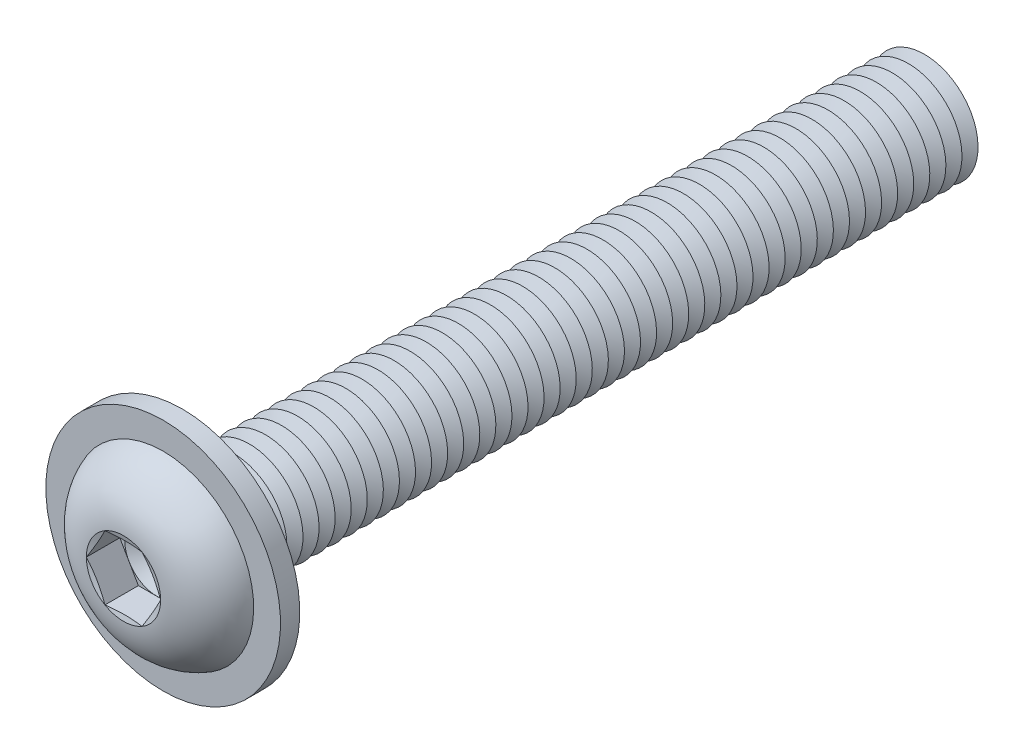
ISO-10303-21;
HEADER;
FILE_DESCRIPTION(('STEP AP214'),'2;1');
FILE_NAME('part.step','',(''),(''),'','','');
FILE_SCHEMA(('AUTOMOTIVE_DESIGN { 1 0 10303 214 1 1 1 1 }'));
ENDSEC;
DATA;
#1=APPLICATION_CONTEXT('core data for automotive mechanical design processes');
#2=APPLICATION_PROTOCOL_DEFINITION('international standard','automotive_design',2000,#1);
#3=PRODUCT_CONTEXT('',#1,'mechanical');
#4=PRODUCT('Part','Part','',(#3));
#5=PRODUCT_RELATED_PRODUCT_CATEGORY('part','',(#4));
#6=PRODUCT_DEFINITION_FORMATION('','',#4);
#7=PRODUCT_DEFINITION_CONTEXT('part definition',#1,'design');
#8=PRODUCT_DEFINITION('design','',#6,#7);
#9=PRODUCT_DEFINITION_SHAPE('','',#8);
#10=(LENGTH_UNIT() NAMED_UNIT(*) SI_UNIT(.MILLI.,.METRE.));
#11=(NAMED_UNIT(*) PLANE_ANGLE_UNIT() SI_UNIT($,.RADIAN.));
#12=(NAMED_UNIT(*) SI_UNIT($,.STERADIAN.) SOLID_ANGLE_UNIT());
#13=UNCERTAINTY_MEASURE_WITH_UNIT(LENGTH_MEASURE(1.E-05),#10,'distance_accuracy_value','');
#14=(GEOMETRIC_REPRESENTATION_CONTEXT(3) GLOBAL_UNCERTAINTY_ASSIGNED_CONTEXT((#13)) GLOBAL_UNIT_ASSIGNED_CONTEXT((#10,
#11,#12)) REPRESENTATION_CONTEXT('',''));
#15=CARTESIAN_POINT('',(0.,0.,0.));
#16=DIRECTION('',(0.,0.,1.));
#17=DIRECTION('',(1.,0.,0.));
#18=AXIS2_PLACEMENT_3D('',#15,#16,#17);
#19=CARTESIAN_POINT('',(0.,0.,-64.75));
#20=DIRECTION('',(0.,0.,1.));
#21=DIRECTION('',(0.,-1.,0.));
#22=AXIS2_PLACEMENT_3D('',#19,#20,#21);
#23=CONICAL_SURFACE('',#22,4.99999999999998,1.0471975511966);
#24=CARTESIAN_POINT('',(0.,0.,-65.5));
#25=DIRECTION('',(0.,0.,1.));
#26=DIRECTION('',(0.,-1.,0.));
#27=AXIS2_PLACEMENT_3D('',#24,#25,#26);
#28=CIRCLE('',#27,3.70096189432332);
#29=CARTESIAN_POINT('',(0.,-3.70096189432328,-65.5));
#30=VERTEX_POINT('',#29);
#31=EDGE_CURVE('E387',#30,#30,#28,.T.);
#32=ORIENTED_EDGE('',*,*,#31,.T.);
#33=EDGE_LOOP('',(#32));
#34=FACE_BOUND('',#33,.T.);
#35=CARTESIAN_POINT('',(0.,0.,-64.75));
#36=DIRECTION('',(0.,0.,1.));
#37=DIRECTION('',(0.,-1.,0.));
#38=AXIS2_PLACEMENT_3D('',#35,#36,#37);
#39=CIRCLE('',#38,4.99999999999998);
#40=CARTESIAN_POINT('',(0.,-4.99999999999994,-64.75));
#41=VERTEX_POINT('',#40);
#42=EDGE_CURVE('E328',#41,#41,#39,.T.);
#43=ORIENTED_EDGE('',*,*,#42,.F.);
#44=EDGE_LOOP('',(#43));
#45=FACE_BOUND('',#44,.T.);
#46=ADVANCED_FACE('F39',(#34,#45),#23,.T.);
#47=CARTESIAN_POINT('',(0.,0.,-65.5));
#48=DIRECTION('',(0.,0.,-1.));
#49=DIRECTION('',(0.,1.,0.));
#50=AXIS2_PLACEMENT_3D('',#47,#48,#49);
#51=CONICAL_SURFACE('',#50,3.70096189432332,1.0471975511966);
#52=CARTESIAN_POINT('',(0.,0.,-66.25));
#53=DIRECTION('',(0.,0.,1.));
#54=DIRECTION('',(0.,-1.,0.));
#55=AXIS2_PLACEMENT_3D('',#52,#53,#54);
#56=CIRCLE('',#55,4.99999999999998);
#57=CARTESIAN_POINT('',(0.,-4.99999999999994,-66.25));
#58=VERTEX_POINT('',#57);
#59=EDGE_CURVE('E384',#58,#58,#56,.T.);
#60=ORIENTED_EDGE('',*,*,#59,.T.);
#61=EDGE_LOOP('',(#60));
#62=FACE_BOUND('',#61,.T.);
#63=ORIENTED_EDGE('',*,*,#31,.F.);
#64=EDGE_LOOP('',(#63));
#65=FACE_BOUND('',#64,.T.);
#66=ADVANCED_FACE('F708',(#62,#65),#51,.T.);
#67=CARTESIAN_POINT('',(0.,4.99999999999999,-70.));
#68=DIRECTION('',(0.,0.,-1.));
#69=DIRECTION('',(0.,1.,0.));
#70=AXIS2_PLACEMENT_3D('',#67,#68,#69);
#71=PLANE('',#70);
#72=CARTESIAN_POINT('',(0.,0.,-70.));
#73=DIRECTION('',(0.,0.,1.));
#74=DIRECTION('',(0.,-1.,0.));
#75=AXIS2_PLACEMENT_3D('',#72,#73,#74);
#76=CIRCLE('',#75,3.70096189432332);
#77=CARTESIAN_POINT('',(0.,-3.70096189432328,-70.));
#78=VERTEX_POINT('',#77);
#79=EDGE_CURVE('E323',#78,#78,#76,.T.);
#80=ORIENTED_EDGE('',*,*,#79,.F.);
#81=EDGE_LOOP('',(#80));
#82=FACE_BOUND('',#81,.T.);
#83=ADVANCED_FACE('F714',(#82),#71,.T.);
#84=CARTESIAN_POINT('',(0.,0.,-69.25));
#85=DIRECTION('',(0.,0.,1.));
#86=DIRECTION('',(0.,-1.,0.));
#87=AXIS2_PLACEMENT_3D('',#84,#85,#86);
#88=CONICAL_SURFACE('',#87,4.99999999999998,1.0471975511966);
#89=ORIENTED_EDGE('',*,*,#79,.T.);
#90=EDGE_LOOP('',(#89));
#91=FACE_BOUND('',#90,.T.);
#92=CARTESIAN_POINT('',(0.,0.,-69.25));
#93=DIRECTION('',(0.,0.,1.));
#94=DIRECTION('',(0.,-1.,0.));
#95=AXIS2_PLACEMENT_3D('',#92,#93,#94);
#96=CIRCLE('',#95,4.99999999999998);
#97=CARTESIAN_POINT('',(0.,-4.99999999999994,-69.25));
#98=VERTEX_POINT('',#97);
#99=EDGE_CURVE('E365',#98,#98,#96,.T.);
#100=ORIENTED_EDGE('',*,*,#99,.F.);
#101=EDGE_LOOP('',(#100));
#102=FACE_BOUND('',#101,.T.);
#103=ADVANCED_FACE('F733',(#91,#102),#88,.T.);
#104=CARTESIAN_POINT('',(0.,0.,-68.5));
#105=DIRECTION('',(0.,0.,-1.));
#106=DIRECTION('',(0.,1.,0.));
#107=AXIS2_PLACEMENT_3D('',#104,#105,#106);
#108=CONICAL_SURFACE('',#107,3.70096189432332,1.0471975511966);
#109=ORIENTED_EDGE('',*,*,#99,.T.);
#110=EDGE_LOOP('',(#109));
#111=FACE_BOUND('',#110,.T.);
#112=CARTESIAN_POINT('',(0.,0.,-68.5));
#113=DIRECTION('',(0.,0.,1.));
#114=DIRECTION('',(0.,-1.,0.));
#115=AXIS2_PLACEMENT_3D('',#112,#113,#114);
#116=CIRCLE('',#115,3.70096189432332);
#117=CARTESIAN_POINT('',(0.,-3.70096189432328,-68.5));
#118=VERTEX_POINT('',#117);
#119=EDGE_CURVE('E370',#118,#118,#116,.T.);
#120=ORIENTED_EDGE('',*,*,#119,.F.);
#121=EDGE_LOOP('',(#120));
#122=FACE_BOUND('',#121,.T.);
#123=ADVANCED_FACE('F730',(#111,#122),#108,.T.);
#124=CARTESIAN_POINT('',(0.,0.,-67.75));
#125=DIRECTION('',(0.,0.,1.));
#126=DIRECTION('',(0.,-1.,0.));
#127=AXIS2_PLACEMENT_3D('',#124,#125,#126);
#128=CONICAL_SURFACE('',#127,4.99999999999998,1.0471975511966);
#129=ORIENTED_EDGE('',*,*,#119,.T.);
#130=EDGE_LOOP('',(#129));
#131=FACE_BOUND('',#130,.T.);
#132=CARTESIAN_POINT('',(0.,0.,-67.75));
#133=DIRECTION('',(0.,0.,1.));
#134=DIRECTION('',(0.,-1.,0.));
#135=AXIS2_PLACEMENT_3D('',#132,#133,#134);
#136=CIRCLE('',#135,4.99999999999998);
#137=CARTESIAN_POINT('',(0.,-4.99999999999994,-67.75));
#138=VERTEX_POINT('',#137);
#139=EDGE_CURVE('E376',#138,#138,#136,.T.);
#140=ORIENTED_EDGE('',*,*,#139,.F.);
#141=EDGE_LOOP('',(#140));
#142=FACE_BOUND('',#141,.T.);
#143=ADVANCED_FACE('F724',(#131,#142),#128,.T.);
#144=CARTESIAN_POINT('',(0.,0.,-67.));
#145=DIRECTION('',(0.,0.,-1.));
#146=DIRECTION('',(0.,1.,0.));
#147=AXIS2_PLACEMENT_3D('',#144,#145,#146);
#148=CONICAL_SURFACE('',#147,3.70096189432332,1.0471975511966);
#149=ORIENTED_EDGE('',*,*,#139,.T.);
#150=EDGE_LOOP('',(#149));
#151=FACE_BOUND('',#150,.T.);
#152=CARTESIAN_POINT('',(0.,0.,-67.));
#153=DIRECTION('',(0.,0.,1.));
#154=DIRECTION('',(0.,-1.,0.));
#155=AXIS2_PLACEMENT_3D('',#152,#153,#154);
#156=CIRCLE('',#155,3.70096189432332);
#157=CARTESIAN_POINT('',(0.,-3.70096189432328,-67.));
#158=VERTEX_POINT('',#157);
#159=EDGE_CURVE('E380',#158,#158,#156,.T.);
#160=ORIENTED_EDGE('',*,*,#159,.F.);
#161=EDGE_LOOP('',(#160));
#162=FACE_BOUND('',#161,.T.);
#163=ADVANCED_FACE('F720',(#151,#162),#148,.T.);
#164=CARTESIAN_POINT('',(0.,0.,-66.25));
#165=DIRECTION('',(0.,0.,1.));
#166=DIRECTION('',(0.,-1.,0.));
#167=AXIS2_PLACEMENT_3D('',#164,#165,#166);
#168=CONICAL_SURFACE('',#167,4.99999999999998,1.0471975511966);
#169=ORIENTED_EDGE('',*,*,#159,.T.);
#170=EDGE_LOOP('',(#169));
#171=FACE_BOUND('',#170,.T.);
#172=ORIENTED_EDGE('',*,*,#59,.F.);
#173=EDGE_LOOP('',(#172));
#174=FACE_BOUND('',#173,.T.);
#175=ADVANCED_FACE('F723',(#171,#174),#168,.T.);
#176=CARTESIAN_POINT('',(0.,0.,-63.25));
#177=DIRECTION('',(0.,0.,1.));
#178=DIRECTION('',(0.,-1.,0.));
#179=AXIS2_PLACEMENT_3D('',#176,#177,#178);
#180=CONICAL_SURFACE('',#179,4.99999999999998,1.0471975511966);
#181=CARTESIAN_POINT('',(0.,0.,-64.));
#182=DIRECTION('',(0.,0.,1.));
#183=DIRECTION('',(0.,-1.,0.));
#184=AXIS2_PLACEMENT_3D('',#181,#182,#183);
#185=CIRCLE('',#184,3.70096189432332);
#186=CARTESIAN_POINT('',(0.,-3.70096189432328,-64.));
#187=VERTEX_POINT('',#186);
#188=EDGE_CURVE('E393',#187,#187,#185,.T.);
#189=ORIENTED_EDGE('',*,*,#188,.T.);
#190=EDGE_LOOP('',(#189));
#191=FACE_BOUND('',#190,.T.);
#192=CARTESIAN_POINT('',(0.,0.,-63.25));
#193=DIRECTION('',(0.,0.,1.));
#194=DIRECTION('',(0.,-1.,0.));
#195=AXIS2_PLACEMENT_3D('',#192,#193,#194);
#196=CIRCLE('',#195,4.99999999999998);
#197=CARTESIAN_POINT('',(0.,-4.99999999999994,-63.25));
#198=VERTEX_POINT('',#197);
#199=EDGE_CURVE('E397',#198,#198,#196,.T.);
#200=ORIENTED_EDGE('',*,*,#199,.F.);
#201=EDGE_LOOP('',(#200));
#202=FACE_BOUND('',#201,.T.);
#203=ADVANCED_FACE('F728',(#191,#202),#180,.T.);
#204=CARTESIAN_POINT('',(0.,0.,-64.));
#205=DIRECTION('',(0.,0.,-1.));
#206=DIRECTION('',(0.,1.,0.));
#207=AXIS2_PLACEMENT_3D('',#204,#205,#206);
#208=CONICAL_SURFACE('',#207,3.70096189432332,1.0471975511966);
#209=ORIENTED_EDGE('',*,*,#42,.T.);
#210=EDGE_LOOP('',(#209));
#211=FACE_BOUND('',#210,.T.);
#212=ORIENTED_EDGE('',*,*,#188,.F.);
#213=EDGE_LOOP('',(#212));
#214=FACE_BOUND('',#213,.T.);
#215=ADVANCED_FACE('F765',(#211,#214),#208,.T.);
#216=CARTESIAN_POINT('',(0.,0.,-61.75));
#217=DIRECTION('',(0.,0.,1.));
#218=DIRECTION('',(0.,-1.,0.));
#219=AXIS2_PLACEMENT_3D('',#216,#217,#218);
#220=CONICAL_SURFACE('',#219,4.99999999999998,1.0471975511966);
#221=CARTESIAN_POINT('',(0.,0.,-62.5));
#222=DIRECTION('',(0.,0.,1.));
#223=DIRECTION('',(0.,-1.,0.));
#224=AXIS2_PLACEMENT_3D('',#221,#222,#223);
#225=CIRCLE('',#224,3.70096189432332);
#226=CARTESIAN_POINT('',(0.,-3.70096189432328,-62.5));
#227=VERTEX_POINT('',#226);
#228=EDGE_CURVE('E401',#227,#227,#225,.T.);
#229=ORIENTED_EDGE('',*,*,#228,.T.);
#230=EDGE_LOOP('',(#229));
#231=FACE_BOUND('',#230,.T.);
#232=CARTESIAN_POINT('',(0.,0.,-61.75));
#233=DIRECTION('',(0.,0.,1.));
#234=DIRECTION('',(0.,-1.,0.));
#235=AXIS2_PLACEMENT_3D('',#232,#233,#234);
#236=CIRCLE('',#235,4.99999999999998);
#237=CARTESIAN_POINT('',(0.,-4.99999999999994,-61.75));
#238=VERTEX_POINT('',#237);
#239=EDGE_CURVE('E405',#238,#238,#236,.T.);
#240=ORIENTED_EDGE('',*,*,#239,.F.);
#241=EDGE_LOOP('',(#240));
#242=FACE_BOUND('',#241,.T.);
#243=ADVANCED_FACE('F771',(#231,#242),#220,.T.);
#244=CARTESIAN_POINT('',(0.,0.,-62.5));
#245=DIRECTION('',(0.,0.,-1.));
#246=DIRECTION('',(0.,1.,0.));
#247=AXIS2_PLACEMENT_3D('',#244,#245,#246);
#248=CONICAL_SURFACE('',#247,3.70096189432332,1.0471975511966);
#249=ORIENTED_EDGE('',*,*,#199,.T.);
#250=EDGE_LOOP('',(#249));
#251=FACE_BOUND('',#250,.T.);
#252=ORIENTED_EDGE('',*,*,#228,.F.);
#253=EDGE_LOOP('',(#252));
#254=FACE_BOUND('',#253,.T.);
#255=ADVANCED_FACE('F778',(#251,#254),#248,.T.);
#256=CARTESIAN_POINT('',(0.,0.,-60.25));
#257=DIRECTION('',(0.,0.,1.));
#258=DIRECTION('',(0.,-1.,0.));
#259=AXIS2_PLACEMENT_3D('',#256,#257,#258);
#260=CONICAL_SURFACE('',#259,4.99999999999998,1.0471975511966);
#261=CARTESIAN_POINT('',(0.,0.,-61.));
#262=DIRECTION('',(0.,0.,1.));
#263=DIRECTION('',(0.,-1.,0.));
#264=AXIS2_PLACEMENT_3D('',#261,#262,#263);
#265=CIRCLE('',#264,3.70096189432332);
#266=CARTESIAN_POINT('',(0.,-3.70096189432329,-61.));
#267=VERTEX_POINT('',#266);
#268=EDGE_CURVE('E409',#267,#267,#265,.T.);
#269=ORIENTED_EDGE('',*,*,#268,.T.);
#270=EDGE_LOOP('',(#269));
#271=FACE_BOUND('',#270,.T.);
#272=CARTESIAN_POINT('',(0.,0.,-60.25));
#273=DIRECTION('',(0.,0.,1.));
#274=DIRECTION('',(0.,-1.,0.));
#275=AXIS2_PLACEMENT_3D('',#272,#273,#274);
#276=CIRCLE('',#275,4.99999999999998);
#277=CARTESIAN_POINT('',(0.,-4.99999999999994,-60.25));
#278=VERTEX_POINT('',#277);
#279=EDGE_CURVE('E413',#278,#278,#276,.T.);
#280=ORIENTED_EDGE('',*,*,#279,.F.);
#281=EDGE_LOOP('',(#280));
#282=FACE_BOUND('',#281,.T.);
#283=ADVANCED_FACE('F785',(#271,#282),#260,.T.);
#284=CARTESIAN_POINT('',(0.,0.,-61.));
#285=DIRECTION('',(0.,0.,-1.));
#286=DIRECTION('',(0.,1.,0.));
#287=AXIS2_PLACEMENT_3D('',#284,#285,#286);
#288=CONICAL_SURFACE('',#287,3.70096189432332,1.0471975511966);
#289=ORIENTED_EDGE('',*,*,#239,.T.);
#290=EDGE_LOOP('',(#289));
#291=FACE_BOUND('',#290,.T.);
#292=ORIENTED_EDGE('',*,*,#268,.F.);
#293=EDGE_LOOP('',(#292));
#294=FACE_BOUND('',#293,.T.);
#295=ADVANCED_FACE('F792',(#291,#294),#288,.T.);
#296=CARTESIAN_POINT('',(0.,0.,-58.75));
#297=DIRECTION('',(0.,0.,1.));
#298=DIRECTION('',(0.,-1.,0.));
#299=AXIS2_PLACEMENT_3D('',#296,#297,#298);
#300=CONICAL_SURFACE('',#299,4.99999999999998,1.0471975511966);
#301=CARTESIAN_POINT('',(0.,0.,-59.5));
#302=DIRECTION('',(0.,0.,1.));
#303=DIRECTION('',(0.,-1.,0.));
#304=AXIS2_PLACEMENT_3D('',#301,#302,#303);
#305=CIRCLE('',#304,3.70096189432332);
#306=CARTESIAN_POINT('',(0.,-3.70096189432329,-59.5));
#307=VERTEX_POINT('',#306);
#308=EDGE_CURVE('E417',#307,#307,#305,.T.);
#309=ORIENTED_EDGE('',*,*,#308,.T.);
#310=EDGE_LOOP('',(#309));
#311=FACE_BOUND('',#310,.T.);
#312=CARTESIAN_POINT('',(0.,0.,-58.75));
#313=DIRECTION('',(0.,0.,1.));
#314=DIRECTION('',(0.,-1.,0.));
#315=AXIS2_PLACEMENT_3D('',#312,#313,#314);
#316=CIRCLE('',#315,4.99999999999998);
#317=CARTESIAN_POINT('',(0.,-4.99999999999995,-58.75));
#318=VERTEX_POINT('',#317);
#319=EDGE_CURVE('E361',#318,#318,#316,.T.);
#320=ORIENTED_EDGE('',*,*,#319,.F.);
#321=EDGE_LOOP('',(#320));
#322=FACE_BOUND('',#321,.T.);
#323=ADVANCED_FACE('F799',(#311,#322),#300,.T.);
#324=CARTESIAN_POINT('',(0.,0.,-59.5));
#325=DIRECTION('',(0.,0.,-1.));
#326=DIRECTION('',(0.,1.,0.));
#327=AXIS2_PLACEMENT_3D('',#324,#325,#326);
#328=CONICAL_SURFACE('',#327,3.70096189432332,1.0471975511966);
#329=ORIENTED_EDGE('',*,*,#279,.T.);
#330=EDGE_LOOP('',(#329));
#331=FACE_BOUND('',#330,.T.);
#332=ORIENTED_EDGE('',*,*,#308,.F.);
#333=EDGE_LOOP('',(#332));
#334=FACE_BOUND('',#333,.T.);
#335=ADVANCED_FACE('F806',(#331,#334),#328,.T.);
#336=CARTESIAN_POINT('',(0.,0.,-57.25));
#337=DIRECTION('',(0.,0.,1.));
#338=DIRECTION('',(0.,-1.,0.));
#339=AXIS2_PLACEMENT_3D('',#336,#337,#338);
#340=CONICAL_SURFACE('',#339,4.99999999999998,1.0471975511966);
#341=CARTESIAN_POINT('',(0.,0.,-58.));
#342=DIRECTION('',(0.,0.,1.));
#343=DIRECTION('',(0.,-1.,0.));
#344=AXIS2_PLACEMENT_3D('',#341,#342,#343);
#345=CIRCLE('',#344,3.70096189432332);
#346=CARTESIAN_POINT('',(0.,-3.70096189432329,-58.));
#347=VERTEX_POINT('',#346);
#348=EDGE_CURVE('E359',#347,#347,#345,.T.);
#349=ORIENTED_EDGE('',*,*,#348,.T.);
#350=EDGE_LOOP('',(#349));
#351=FACE_BOUND('',#350,.T.);
#352=CARTESIAN_POINT('',(0.,0.,-57.25));
#353=DIRECTION('',(0.,0.,1.));
#354=DIRECTION('',(0.,-1.,0.));
#355=AXIS2_PLACEMENT_3D('',#352,#353,#354);
#356=CIRCLE('',#355,4.99999999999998);
#357=CARTESIAN_POINT('',(0.,-4.99999999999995,-57.25));
#358=VERTEX_POINT('',#357);
#359=EDGE_CURVE('E362',#358,#358,#356,.T.);
#360=ORIENTED_EDGE('',*,*,#359,.F.);
#361=EDGE_LOOP('',(#360));
#362=FACE_BOUND('',#361,.T.);
#363=ADVANCED_FACE('F813',(#351,#362),#340,.T.);
#364=CARTESIAN_POINT('',(0.,0.,-58.));
#365=DIRECTION('',(0.,0.,-1.));
#366=DIRECTION('',(0.,1.,0.));
#367=AXIS2_PLACEMENT_3D('',#364,#365,#366);
#368=CONICAL_SURFACE('',#367,3.70096189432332,1.0471975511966);
#369=ORIENTED_EDGE('',*,*,#319,.T.);
#370=EDGE_LOOP('',(#369));
#371=FACE_BOUND('',#370,.T.);
#372=ORIENTED_EDGE('',*,*,#348,.F.);
#373=EDGE_LOOP('',(#372));
#374=FACE_BOUND('',#373,.T.);
#375=ADVANCED_FACE('F820',(#371,#374),#368,.T.);
#376=CARTESIAN_POINT('',(0.,0.,-55.75));
#377=DIRECTION('',(0.,0.,1.));
#378=DIRECTION('',(0.,-1.,0.));
#379=AXIS2_PLACEMENT_3D('',#376,#377,#378);
#380=CONICAL_SURFACE('',#379,4.99999999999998,1.0471975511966);
#381=CARTESIAN_POINT('',(0.,0.,-56.5));
#382=DIRECTION('',(0.,0.,1.));
#383=DIRECTION('',(0.,-1.,0.));
#384=AXIS2_PLACEMENT_3D('',#381,#382,#383);
#385=CIRCLE('',#384,3.70096189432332);
#386=CARTESIAN_POINT('',(0.,-3.70096189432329,-56.5));
#387=VERTEX_POINT('',#386);
#388=EDGE_CURVE('E427',#387,#387,#385,.T.);
#389=ORIENTED_EDGE('',*,*,#388,.T.);
#390=EDGE_LOOP('',(#389));
#391=FACE_BOUND('',#390,.T.);
#392=CARTESIAN_POINT('',(0.,0.,-55.75));
#393=DIRECTION('',(0.,0.,1.));
#394=DIRECTION('',(0.,-1.,0.));
#395=AXIS2_PLACEMENT_3D('',#392,#393,#394);
#396=CIRCLE('',#395,4.99999999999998);
#397=CARTESIAN_POINT('',(0.,-4.99999999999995,-55.75));
#398=VERTEX_POINT('',#397);
#399=EDGE_CURVE('E431',#398,#398,#396,.T.);
#400=ORIENTED_EDGE('',*,*,#399,.F.);
#401=EDGE_LOOP('',(#400));
#402=FACE_BOUND('',#401,.T.);
#403=ADVANCED_FACE('F827',(#391,#402),#380,.T.);
#404=CARTESIAN_POINT('',(0.,0.,-56.5));
#405=DIRECTION('',(0.,0.,-1.));
#406=DIRECTION('',(0.,1.,0.));
#407=AXIS2_PLACEMENT_3D('',#404,#405,#406);
#408=CONICAL_SURFACE('',#407,3.70096189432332,1.0471975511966);
#409=ORIENTED_EDGE('',*,*,#359,.T.);
#410=EDGE_LOOP('',(#409));
#411=FACE_BOUND('',#410,.T.);
#412=ORIENTED_EDGE('',*,*,#388,.F.);
#413=EDGE_LOOP('',(#412));
#414=FACE_BOUND('',#413,.T.);
#415=ADVANCED_FACE('F834',(#411,#414),#408,.T.);
#416=CARTESIAN_POINT('',(0.,0.,-54.25));
#417=DIRECTION('',(0.,0.,1.));
#418=DIRECTION('',(0.,-1.,0.));
#419=AXIS2_PLACEMENT_3D('',#416,#417,#418);
#420=CONICAL_SURFACE('',#419,4.99999999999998,1.0471975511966);
#421=CARTESIAN_POINT('',(0.,0.,-55.));
#422=DIRECTION('',(0.,0.,1.));
#423=DIRECTION('',(0.,-1.,0.));
#424=AXIS2_PLACEMENT_3D('',#421,#422,#423);
#425=CIRCLE('',#424,3.70096189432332);
#426=CARTESIAN_POINT('',(0.,-3.70096189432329,-55.));
#427=VERTEX_POINT('',#426);
#428=EDGE_CURVE('E435',#427,#427,#425,.T.);
#429=ORIENTED_EDGE('',*,*,#428,.T.);
#430=EDGE_LOOP('',(#429));
#431=FACE_BOUND('',#430,.T.);
#432=CARTESIAN_POINT('',(0.,0.,-54.25));
#433=DIRECTION('',(0.,0.,1.));
#434=DIRECTION('',(0.,-1.,0.));
#435=AXIS2_PLACEMENT_3D('',#432,#433,#434);
#436=CIRCLE('',#435,4.99999999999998);
#437=CARTESIAN_POINT('',(0.,-4.99999999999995,-54.25));
#438=VERTEX_POINT('',#437);
#439=EDGE_CURVE('E439',#438,#438,#436,.T.);
#440=ORIENTED_EDGE('',*,*,#439,.F.);
#441=EDGE_LOOP('',(#440));
#442=FACE_BOUND('',#441,.T.);
#443=ADVANCED_FACE('F841',(#431,#442),#420,.T.);
#444=CARTESIAN_POINT('',(0.,0.,-55.));
#445=DIRECTION('',(0.,0.,-1.));
#446=DIRECTION('',(0.,1.,0.));
#447=AXIS2_PLACEMENT_3D('',#444,#445,#446);
#448=CONICAL_SURFACE('',#447,3.70096189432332,1.0471975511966);
#449=ORIENTED_EDGE('',*,*,#399,.T.);
#450=EDGE_LOOP('',(#449));
#451=FACE_BOUND('',#450,.T.);
#452=ORIENTED_EDGE('',*,*,#428,.F.);
#453=EDGE_LOOP('',(#452));
#454=FACE_BOUND('',#453,.T.);
#455=ADVANCED_FACE('F848',(#451,#454),#448,.T.);
#456=CARTESIAN_POINT('',(0.,0.,-52.75));
#457=DIRECTION('',(0.,0.,1.));
#458=DIRECTION('',(0.,-1.,0.));
#459=AXIS2_PLACEMENT_3D('',#456,#457,#458);
#460=CONICAL_SURFACE('',#459,4.99999999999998,1.0471975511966);
#461=CARTESIAN_POINT('',(0.,0.,-53.5));
#462=DIRECTION('',(0.,0.,1.));
#463=DIRECTION('',(0.,-1.,0.));
#464=AXIS2_PLACEMENT_3D('',#461,#462,#463);
#465=CIRCLE('',#464,3.70096189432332);
#466=CARTESIAN_POINT('',(0.,-3.70096189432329,-53.5));
#467=VERTEX_POINT('',#466);
#468=EDGE_CURVE('E443',#467,#467,#465,.T.);
#469=ORIENTED_EDGE('',*,*,#468,.T.);
#470=EDGE_LOOP('',(#469));
#471=FACE_BOUND('',#470,.T.);
#472=CARTESIAN_POINT('',(0.,0.,-52.75));
#473=DIRECTION('',(0.,0.,1.));
#474=DIRECTION('',(0.,-1.,0.));
#475=AXIS2_PLACEMENT_3D('',#472,#473,#474);
#476=CIRCLE('',#475,4.99999999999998);
#477=CARTESIAN_POINT('',(0.,-4.99999999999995,-52.75));
#478=VERTEX_POINT('',#477);
#479=EDGE_CURVE('E447',#478,#478,#476,.T.);
#480=ORIENTED_EDGE('',*,*,#479,.F.);
#481=EDGE_LOOP('',(#480));
#482=FACE_BOUND('',#481,.T.);
#483=ADVANCED_FACE('F855',(#471,#482),#460,.T.);
#484=CARTESIAN_POINT('',(0.,0.,-53.5));
#485=DIRECTION('',(0.,0.,-1.));
#486=DIRECTION('',(0.,1.,0.));
#487=AXIS2_PLACEMENT_3D('',#484,#485,#486);
#488=CONICAL_SURFACE('',#487,3.70096189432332,1.0471975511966);
#489=ORIENTED_EDGE('',*,*,#439,.T.);
#490=EDGE_LOOP('',(#489));
#491=FACE_BOUND('',#490,.T.);
#492=ORIENTED_EDGE('',*,*,#468,.F.);
#493=EDGE_LOOP('',(#492));
#494=FACE_BOUND('',#493,.T.);
#495=ADVANCED_FACE('F862',(#491,#494),#488,.T.);
#496=CARTESIAN_POINT('',(0.,0.,-51.25));
#497=DIRECTION('',(0.,0.,1.));
#498=DIRECTION('',(0.,-1.,0.));
#499=AXIS2_PLACEMENT_3D('',#496,#497,#498);
#500=CONICAL_SURFACE('',#499,4.99999999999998,1.0471975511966);
#501=CARTESIAN_POINT('',(0.,0.,-52.));
#502=DIRECTION('',(0.,0.,1.));
#503=DIRECTION('',(0.,-1.,0.));
#504=AXIS2_PLACEMENT_3D('',#501,#502,#503);
#505=CIRCLE('',#504,3.70096189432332);
#506=CARTESIAN_POINT('',(0.,-3.70096189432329,-52.));
#507=VERTEX_POINT('',#506);
#508=EDGE_CURVE('E451',#507,#507,#505,.T.);
#509=ORIENTED_EDGE('',*,*,#508,.T.);
#510=EDGE_LOOP('',(#509));
#511=FACE_BOUND('',#510,.T.);
#512=CARTESIAN_POINT('',(0.,0.,-51.25));
#513=DIRECTION('',(0.,0.,1.));
#514=DIRECTION('',(0.,-1.,0.));
#515=AXIS2_PLACEMENT_3D('',#512,#513,#514);
#516=CIRCLE('',#515,4.99999999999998);
#517=CARTESIAN_POINT('',(0.,-4.99999999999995,-51.25));
#518=VERTEX_POINT('',#517);
#519=EDGE_CURVE('E455',#518,#518,#516,.T.);
#520=ORIENTED_EDGE('',*,*,#519,.F.);
#521=EDGE_LOOP('',(#520));
#522=FACE_BOUND('',#521,.T.);
#523=ADVANCED_FACE('F869',(#511,#522),#500,.T.);
#524=CARTESIAN_POINT('',(0.,0.,-52.));
#525=DIRECTION('',(0.,0.,-1.));
#526=DIRECTION('',(0.,1.,0.));
#527=AXIS2_PLACEMENT_3D('',#524,#525,#526);
#528=CONICAL_SURFACE('',#527,3.70096189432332,1.0471975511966);
#529=ORIENTED_EDGE('',*,*,#479,.T.);
#530=EDGE_LOOP('',(#529));
#531=FACE_BOUND('',#530,.T.);
#532=ORIENTED_EDGE('',*,*,#508,.F.);
#533=EDGE_LOOP('',(#532));
#534=FACE_BOUND('',#533,.T.);
#535=ADVANCED_FACE('F876',(#531,#534),#528,.T.);
#536=CARTESIAN_POINT('',(0.,0.,-49.75));
#537=DIRECTION('',(0.,0.,1.));
#538=DIRECTION('',(0.,-1.,0.));
#539=AXIS2_PLACEMENT_3D('',#536,#537,#538);
#540=CONICAL_SURFACE('',#539,4.99999999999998,1.0471975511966);
#541=CARTESIAN_POINT('',(0.,0.,-50.5));
#542=DIRECTION('',(0.,0.,1.));
#543=DIRECTION('',(0.,-1.,0.));
#544=AXIS2_PLACEMENT_3D('',#541,#542,#543);
#545=CIRCLE('',#544,3.70096189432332);
#546=CARTESIAN_POINT('',(0.,-3.70096189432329,-50.5));
#547=VERTEX_POINT('',#546);
#548=EDGE_CURVE('E459',#547,#547,#545,.T.);
#549=ORIENTED_EDGE('',*,*,#548,.T.);
#550=EDGE_LOOP('',(#549));
#551=FACE_BOUND('',#550,.T.);
#552=CARTESIAN_POINT('',(0.,0.,-49.75));
#553=DIRECTION('',(0.,0.,1.));
#554=DIRECTION('',(0.,-1.,0.));
#555=AXIS2_PLACEMENT_3D('',#552,#553,#554);
#556=CIRCLE('',#555,4.99999999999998);
#557=CARTESIAN_POINT('',(0.,-4.99999999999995,-49.75));
#558=VERTEX_POINT('',#557);
#559=EDGE_CURVE('E463',#558,#558,#556,.T.);
#560=ORIENTED_EDGE('',*,*,#559,.F.);
#561=EDGE_LOOP('',(#560));
#562=FACE_BOUND('',#561,.T.);
#563=ADVANCED_FACE('F883',(#551,#562),#540,.T.);
#564=CARTESIAN_POINT('',(0.,0.,-50.5));
#565=DIRECTION('',(0.,0.,-1.));
#566=DIRECTION('',(0.,1.,0.));
#567=AXIS2_PLACEMENT_3D('',#564,#565,#566);
#568=CONICAL_SURFACE('',#567,3.70096189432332,1.0471975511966);
#569=ORIENTED_EDGE('',*,*,#519,.T.);
#570=EDGE_LOOP('',(#569));
#571=FACE_BOUND('',#570,.T.);
#572=ORIENTED_EDGE('',*,*,#548,.F.);
#573=EDGE_LOOP('',(#572));
#574=FACE_BOUND('',#573,.T.);
#575=ADVANCED_FACE('F890',(#571,#574),#568,.T.);
#576=CARTESIAN_POINT('',(0.,0.,-48.25));
#577=DIRECTION('',(0.,0.,1.));
#578=DIRECTION('',(0.,-1.,0.));
#579=AXIS2_PLACEMENT_3D('',#576,#577,#578);
#580=CONICAL_SURFACE('',#579,4.99999999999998,1.0471975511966);
#581=CARTESIAN_POINT('',(0.,0.,-49.));
#582=DIRECTION('',(0.,0.,1.));
#583=DIRECTION('',(0.,-1.,0.));
#584=AXIS2_PLACEMENT_3D('',#581,#582,#583);
#585=CIRCLE('',#584,3.70096189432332);
#586=CARTESIAN_POINT('',(0.,-3.70096189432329,-49.));
#587=VERTEX_POINT('',#586);
#588=EDGE_CURVE('E467',#587,#587,#585,.T.);
#589=ORIENTED_EDGE('',*,*,#588,.T.);
#590=EDGE_LOOP('',(#589));
#591=FACE_BOUND('',#590,.T.);
#592=CARTESIAN_POINT('',(0.,0.,-48.25));
#593=DIRECTION('',(0.,0.,1.));
#594=DIRECTION('',(0.,-1.,0.));
#595=AXIS2_PLACEMENT_3D('',#592,#593,#594);
#596=CIRCLE('',#595,4.99999999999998);
#597=CARTESIAN_POINT('',(0.,-4.99999999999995,-48.25));
#598=VERTEX_POINT('',#597);
#599=EDGE_CURVE('E471',#598,#598,#596,.T.);
#600=ORIENTED_EDGE('',*,*,#599,.F.);
#601=EDGE_LOOP('',(#600));
#602=FACE_BOUND('',#601,.T.);
#603=ADVANCED_FACE('F897',(#591,#602),#580,.T.);
#604=CARTESIAN_POINT('',(0.,0.,-49.));
#605=DIRECTION('',(0.,0.,-1.));
#606=DIRECTION('',(0.,1.,0.));
#607=AXIS2_PLACEMENT_3D('',#604,#605,#606);
#608=CONICAL_SURFACE('',#607,3.70096189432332,1.0471975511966);
#609=ORIENTED_EDGE('',*,*,#559,.T.);
#610=EDGE_LOOP('',(#609));
#611=FACE_BOUND('',#610,.T.);
#612=ORIENTED_EDGE('',*,*,#588,.F.);
#613=EDGE_LOOP('',(#612));
#614=FACE_BOUND('',#613,.T.);
#615=ADVANCED_FACE('F904',(#611,#614),#608,.T.);
#616=CARTESIAN_POINT('',(0.,0.,-46.75));
#617=DIRECTION('',(0.,0.,1.));
#618=DIRECTION('',(0.,-1.,0.));
#619=AXIS2_PLACEMENT_3D('',#616,#617,#618);
#620=CONICAL_SURFACE('',#619,4.99999999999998,1.0471975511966);
#621=CARTESIAN_POINT('',(0.,0.,-47.5));
#622=DIRECTION('',(0.,0.,1.));
#623=DIRECTION('',(0.,-1.,0.));
#624=AXIS2_PLACEMENT_3D('',#621,#622,#623);
#625=CIRCLE('',#624,3.70096189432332);
#626=CARTESIAN_POINT('',(0.,-3.70096189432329,-47.5));
#627=VERTEX_POINT('',#626);
#628=EDGE_CURVE('E475',#627,#627,#625,.T.);
#629=ORIENTED_EDGE('',*,*,#628,.T.);
#630=EDGE_LOOP('',(#629));
#631=FACE_BOUND('',#630,.T.);
#632=CARTESIAN_POINT('',(0.,0.,-46.75));
#633=DIRECTION('',(0.,0.,1.));
#634=DIRECTION('',(0.,-1.,0.));
#635=AXIS2_PLACEMENT_3D('',#632,#633,#634);
#636=CIRCLE('',#635,4.99999999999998);
#637=CARTESIAN_POINT('',(0.,-4.99999999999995,-46.75));
#638=VERTEX_POINT('',#637);
#639=EDGE_CURVE('E479',#638,#638,#636,.T.);
#640=ORIENTED_EDGE('',*,*,#639,.F.);
#641=EDGE_LOOP('',(#640));
#642=FACE_BOUND('',#641,.T.);
#643=ADVANCED_FACE('F911',(#631,#642),#620,.T.);
#644=CARTESIAN_POINT('',(0.,0.,-47.5));
#645=DIRECTION('',(0.,0.,-1.));
#646=DIRECTION('',(0.,1.,0.));
#647=AXIS2_PLACEMENT_3D('',#644,#645,#646);
#648=CONICAL_SURFACE('',#647,3.70096189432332,1.0471975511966);
#649=ORIENTED_EDGE('',*,*,#599,.T.);
#650=EDGE_LOOP('',(#649));
#651=FACE_BOUND('',#650,.T.);
#652=ORIENTED_EDGE('',*,*,#628,.F.);
#653=EDGE_LOOP('',(#652));
#654=FACE_BOUND('',#653,.T.);
#655=ADVANCED_FACE('F918',(#651,#654),#648,.T.);
#656=CARTESIAN_POINT('',(0.,0.,-45.25));
#657=DIRECTION('',(0.,0.,1.));
#658=DIRECTION('',(0.,-1.,0.));
#659=AXIS2_PLACEMENT_3D('',#656,#657,#658);
#660=CONICAL_SURFACE('',#659,4.99999999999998,1.0471975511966);
#661=CARTESIAN_POINT('',(0.,0.,-46.));
#662=DIRECTION('',(0.,0.,1.));
#663=DIRECTION('',(0.,-1.,0.));
#664=AXIS2_PLACEMENT_3D('',#661,#662,#663);
#665=CIRCLE('',#664,3.70096189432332);
#666=CARTESIAN_POINT('',(0.,-3.70096189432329,-46.));
#667=VERTEX_POINT('',#666);
#668=EDGE_CURVE('E483',#667,#667,#665,.T.);
#669=ORIENTED_EDGE('',*,*,#668,.T.);
#670=EDGE_LOOP('',(#669));
#671=FACE_BOUND('',#670,.T.);
#672=CARTESIAN_POINT('',(0.,0.,-45.25));
#673=DIRECTION('',(0.,0.,1.));
#674=DIRECTION('',(0.,-1.,0.));
#675=AXIS2_PLACEMENT_3D('',#672,#673,#674);
#676=CIRCLE('',#675,4.99999999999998);
#677=CARTESIAN_POINT('',(0.,-4.99999999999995,-45.25));
#678=VERTEX_POINT('',#677);
#679=EDGE_CURVE('E487',#678,#678,#676,.T.);
#680=ORIENTED_EDGE('',*,*,#679,.F.);
#681=EDGE_LOOP('',(#680));
#682=FACE_BOUND('',#681,.T.);
#683=ADVANCED_FACE('F925',(#671,#682),#660,.T.);
#684=CARTESIAN_POINT('',(0.,0.,-46.));
#685=DIRECTION('',(0.,0.,-1.));
#686=DIRECTION('',(0.,1.,0.));
#687=AXIS2_PLACEMENT_3D('',#684,#685,#686);
#688=CONICAL_SURFACE('',#687,3.70096189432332,1.0471975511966);
#689=ORIENTED_EDGE('',*,*,#639,.T.);
#690=EDGE_LOOP('',(#689));
#691=FACE_BOUND('',#690,.T.);
#692=ORIENTED_EDGE('',*,*,#668,.F.);
#693=EDGE_LOOP('',(#692));
#694=FACE_BOUND('',#693,.T.);
#695=ADVANCED_FACE('F932',(#691,#694),#688,.T.);
#696=CARTESIAN_POINT('',(0.,0.,-43.75));
#697=DIRECTION('',(0.,0.,1.));
#698=DIRECTION('',(0.,-1.,0.));
#699=AXIS2_PLACEMENT_3D('',#696,#697,#698);
#700=CONICAL_SURFACE('',#699,4.99999999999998,1.0471975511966);
#701=CARTESIAN_POINT('',(0.,0.,-44.5));
#702=DIRECTION('',(0.,0.,1.));
#703=DIRECTION('',(0.,-1.,0.));
#704=AXIS2_PLACEMENT_3D('',#701,#702,#703);
#705=CIRCLE('',#704,3.70096189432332);
#706=CARTESIAN_POINT('',(0.,-3.70096189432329,-44.5));
#707=VERTEX_POINT('',#706);
#708=EDGE_CURVE('E491',#707,#707,#705,.T.);
#709=ORIENTED_EDGE('',*,*,#708,.T.);
#710=EDGE_LOOP('',(#709));
#711=FACE_BOUND('',#710,.T.);
#712=CARTESIAN_POINT('',(0.,0.,-43.75));
#713=DIRECTION('',(0.,0.,1.));
#714=DIRECTION('',(0.,-1.,0.));
#715=AXIS2_PLACEMENT_3D('',#712,#713,#714);
#716=CIRCLE('',#715,4.99999999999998);
#717=CARTESIAN_POINT('',(0.,-4.99999999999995,-43.75));
#718=VERTEX_POINT('',#717);
#719=EDGE_CURVE('E495',#718,#718,#716,.T.);
#720=ORIENTED_EDGE('',*,*,#719,.F.);
#721=EDGE_LOOP('',(#720));
#722=FACE_BOUND('',#721,.T.);
#723=ADVANCED_FACE('F939',(#711,#722),#700,.T.);
#724=CARTESIAN_POINT('',(0.,0.,-44.5));
#725=DIRECTION('',(0.,0.,-1.));
#726=DIRECTION('',(0.,1.,0.));
#727=AXIS2_PLACEMENT_3D('',#724,#725,#726);
#728=CONICAL_SURFACE('',#727,3.70096189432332,1.0471975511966);
#729=ORIENTED_EDGE('',*,*,#679,.T.);
#730=EDGE_LOOP('',(#729));
#731=FACE_BOUND('',#730,.T.);
#732=ORIENTED_EDGE('',*,*,#708,.F.);
#733=EDGE_LOOP('',(#732));
#734=FACE_BOUND('',#733,.T.);
#735=ADVANCED_FACE('F946',(#731,#734),#728,.T.);
#736=CARTESIAN_POINT('',(0.,0.,-42.25));
#737=DIRECTION('',(0.,0.,1.));
#738=DIRECTION('',(0.,-1.,0.));
#739=AXIS2_PLACEMENT_3D('',#736,#737,#738);
#740=CONICAL_SURFACE('',#739,4.99999999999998,1.0471975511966);
#741=CARTESIAN_POINT('',(0.,0.,-43.));
#742=DIRECTION('',(0.,0.,1.));
#743=DIRECTION('',(0.,-1.,0.));
#744=AXIS2_PLACEMENT_3D('',#741,#742,#743);
#745=CIRCLE('',#744,3.70096189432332);
#746=CARTESIAN_POINT('',(0.,-3.70096189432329,-43.));
#747=VERTEX_POINT('',#746);
#748=EDGE_CURVE('E499',#747,#747,#745,.T.);
#749=ORIENTED_EDGE('',*,*,#748,.T.);
#750=EDGE_LOOP('',(#749));
#751=FACE_BOUND('',#750,.T.);
#752=CARTESIAN_POINT('',(0.,0.,-42.25));
#753=DIRECTION('',(0.,0.,1.));
#754=DIRECTION('',(0.,-1.,0.));
#755=AXIS2_PLACEMENT_3D('',#752,#753,#754);
#756=CIRCLE('',#755,4.99999999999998);
#757=CARTESIAN_POINT('',(0.,-4.99999999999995,-42.25));
#758=VERTEX_POINT('',#757);
#759=EDGE_CURVE('E503',#758,#758,#756,.T.);
#760=ORIENTED_EDGE('',*,*,#759,.F.);
#761=EDGE_LOOP('',(#760));
#762=FACE_BOUND('',#761,.T.);
#763=ADVANCED_FACE('F953',(#751,#762),#740,.T.);
#764=CARTESIAN_POINT('',(0.,0.,-43.));
#765=DIRECTION('',(0.,0.,-1.));
#766=DIRECTION('',(0.,1.,0.));
#767=AXIS2_PLACEMENT_3D('',#764,#765,#766);
#768=CONICAL_SURFACE('',#767,3.70096189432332,1.0471975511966);
#769=ORIENTED_EDGE('',*,*,#719,.T.);
#770=EDGE_LOOP('',(#769));
#771=FACE_BOUND('',#770,.T.);
#772=ORIENTED_EDGE('',*,*,#748,.F.);
#773=EDGE_LOOP('',(#772));
#774=FACE_BOUND('',#773,.T.);
#775=ADVANCED_FACE('F960',(#771,#774),#768,.T.);
#776=CARTESIAN_POINT('',(0.,0.,-40.75));
#777=DIRECTION('',(0.,0.,1.));
#778=DIRECTION('',(0.,-1.,0.));
#779=AXIS2_PLACEMENT_3D('',#776,#777,#778);
#780=CONICAL_SURFACE('',#779,4.99999999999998,1.0471975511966);
#781=CARTESIAN_POINT('',(0.,0.,-41.5));
#782=DIRECTION('',(0.,0.,1.));
#783=DIRECTION('',(0.,-1.,0.));
#784=AXIS2_PLACEMENT_3D('',#781,#782,#783);
#785=CIRCLE('',#784,3.70096189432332);
#786=CARTESIAN_POINT('',(0.,-3.70096189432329,-41.5));
#787=VERTEX_POINT('',#786);
#788=EDGE_CURVE('E507',#787,#787,#785,.T.);
#789=ORIENTED_EDGE('',*,*,#788,.T.);
#790=EDGE_LOOP('',(#789));
#791=FACE_BOUND('',#790,.T.);
#792=CARTESIAN_POINT('',(0.,0.,-40.75));
#793=DIRECTION('',(0.,0.,1.));
#794=DIRECTION('',(0.,-1.,0.));
#795=AXIS2_PLACEMENT_3D('',#792,#793,#794);
#796=CIRCLE('',#795,4.99999999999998);
#797=CARTESIAN_POINT('',(0.,-4.99999999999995,-40.75));
#798=VERTEX_POINT('',#797);
#799=EDGE_CURVE('E511',#798,#798,#796,.T.);
#800=ORIENTED_EDGE('',*,*,#799,.F.);
#801=EDGE_LOOP('',(#800));
#802=FACE_BOUND('',#801,.T.);
#803=ADVANCED_FACE('F967',(#791,#802),#780,.T.);
#804=CARTESIAN_POINT('',(0.,0.,-41.5));
#805=DIRECTION('',(0.,0.,-1.));
#806=DIRECTION('',(0.,1.,0.));
#807=AXIS2_PLACEMENT_3D('',#804,#805,#806);
#808=CONICAL_SURFACE('',#807,3.70096189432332,1.0471975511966);
#809=ORIENTED_EDGE('',*,*,#759,.T.);
#810=EDGE_LOOP('',(#809));
#811=FACE_BOUND('',#810,.T.);
#812=ORIENTED_EDGE('',*,*,#788,.F.);
#813=EDGE_LOOP('',(#812));
#814=FACE_BOUND('',#813,.T.);
#815=ADVANCED_FACE('F974',(#811,#814),#808,.T.);
#816=CARTESIAN_POINT('',(0.,0.,-39.25));
#817=DIRECTION('',(0.,0.,1.));
#818=DIRECTION('',(0.,-1.,0.));
#819=AXIS2_PLACEMENT_3D('',#816,#817,#818);
#820=CONICAL_SURFACE('',#819,4.99999999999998,1.0471975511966);
#821=CARTESIAN_POINT('',(0.,0.,-40.));
#822=DIRECTION('',(0.,0.,1.));
#823=DIRECTION('',(0.,-1.,0.));
#824=AXIS2_PLACEMENT_3D('',#821,#822,#823);
#825=CIRCLE('',#824,3.70096189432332);
#826=CARTESIAN_POINT('',(0.,-3.70096189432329,-40.));
#827=VERTEX_POINT('',#826);
#828=EDGE_CURVE('E356',#827,#827,#825,.T.);
#829=ORIENTED_EDGE('',*,*,#828,.T.);
#830=EDGE_LOOP('',(#829));
#831=FACE_BOUND('',#830,.T.);
#832=CARTESIAN_POINT('',(0.,0.,-39.25));
#833=DIRECTION('',(0.,0.,1.));
#834=DIRECTION('',(0.,-1.,0.));
#835=AXIS2_PLACEMENT_3D('',#832,#833,#834);
#836=CIRCLE('',#835,4.99999999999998);
#837=CARTESIAN_POINT('',(0.,-4.99999999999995,-39.25));
#838=VERTEX_POINT('',#837);
#839=EDGE_CURVE('E353',#838,#838,#836,.T.);
#840=ORIENTED_EDGE('',*,*,#839,.F.);
#841=EDGE_LOOP('',(#840));
#842=FACE_BOUND('',#841,.T.);
#843=ADVANCED_FACE('F981',(#831,#842),#820,.T.);
#844=CARTESIAN_POINT('',(0.,0.,-40.));
#845=DIRECTION('',(0.,0.,-1.));
#846=DIRECTION('',(0.,1.,0.));
#847=AXIS2_PLACEMENT_3D('',#844,#845,#846);
#848=CONICAL_SURFACE('',#847,3.70096189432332,1.0471975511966);
#849=ORIENTED_EDGE('',*,*,#799,.T.);
#850=EDGE_LOOP('',(#849));
#851=FACE_BOUND('',#850,.T.);
#852=ORIENTED_EDGE('',*,*,#828,.F.);
#853=EDGE_LOOP('',(#852));
#854=FACE_BOUND('',#853,.T.);
#855=ADVANCED_FACE('F988',(#851,#854),#848,.T.);
#856=CARTESIAN_POINT('',(0.,0.,-37.75));
#857=DIRECTION('',(0.,0.,1.));
#858=DIRECTION('',(0.,-1.,0.));
#859=AXIS2_PLACEMENT_3D('',#856,#857,#858);
#860=CONICAL_SURFACE('',#859,4.99999999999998,1.0471975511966);
#861=CARTESIAN_POINT('',(0.,0.,-38.5));
#862=DIRECTION('',(0.,0.,1.));
#863=DIRECTION('',(0.,-1.,0.));
#864=AXIS2_PLACEMENT_3D('',#861,#862,#863);
#865=CIRCLE('',#864,3.70096189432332);
#866=CARTESIAN_POINT('',(0.,-3.7009618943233,-38.5));
#867=VERTEX_POINT('',#866);
#868=EDGE_CURVE('E357',#867,#867,#865,.T.);
#869=ORIENTED_EDGE('',*,*,#868,.T.);
#870=EDGE_LOOP('',(#869));
#871=FACE_BOUND('',#870,.T.);
#872=CARTESIAN_POINT('',(0.,0.,-37.75));
#873=DIRECTION('',(0.,0.,1.));
#874=DIRECTION('',(0.,-1.,0.));
#875=AXIS2_PLACEMENT_3D('',#872,#873,#874);
#876=CIRCLE('',#875,4.99999999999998);
#877=CARTESIAN_POINT('',(0.,-4.99999999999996,-37.75));
#878=VERTEX_POINT('',#877);
#879=EDGE_CURVE('E521',#878,#878,#876,.T.);
#880=ORIENTED_EDGE('',*,*,#879,.F.);
#881=EDGE_LOOP('',(#880));
#882=FACE_BOUND('',#881,.T.);
#883=ADVANCED_FACE('F995',(#871,#882),#860,.T.);
#884=CARTESIAN_POINT('',(0.,0.,-38.5));
#885=DIRECTION('',(0.,0.,-1.));
#886=DIRECTION('',(0.,1.,0.));
#887=AXIS2_PLACEMENT_3D('',#884,#885,#886);
#888=CONICAL_SURFACE('',#887,3.70096189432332,1.0471975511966);
#889=ORIENTED_EDGE('',*,*,#839,.T.);
#890=EDGE_LOOP('',(#889));
#891=FACE_BOUND('',#890,.T.);
#892=ORIENTED_EDGE('',*,*,#868,.F.);
#893=EDGE_LOOP('',(#892));
#894=FACE_BOUND('',#893,.T.);
#895=ADVANCED_FACE('F1002',(#891,#894),#888,.T.);
#896=CARTESIAN_POINT('',(0.,0.,-36.25));
#897=DIRECTION('',(0.,0.,1.));
#898=DIRECTION('',(0.,-1.,0.));
#899=AXIS2_PLACEMENT_3D('',#896,#897,#898);
#900=CONICAL_SURFACE('',#899,4.99999999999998,1.0471975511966);
#901=CARTESIAN_POINT('',(0.,0.,-37.));
#902=DIRECTION('',(0.,0.,1.));
#903=DIRECTION('',(0.,-1.,0.));
#904=AXIS2_PLACEMENT_3D('',#901,#902,#903);
#905=CIRCLE('',#904,3.70096189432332);
#906=CARTESIAN_POINT('',(0.,-3.7009618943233,-37.));
#907=VERTEX_POINT('',#906);
#908=EDGE_CURVE('E525',#907,#907,#905,.T.);
#909=ORIENTED_EDGE('',*,*,#908,.T.);
#910=EDGE_LOOP('',(#909));
#911=FACE_BOUND('',#910,.T.);
#912=CARTESIAN_POINT('',(0.,0.,-36.25));
#913=DIRECTION('',(0.,0.,1.));
#914=DIRECTION('',(0.,-1.,0.));
#915=AXIS2_PLACEMENT_3D('',#912,#913,#914);
#916=CIRCLE('',#915,4.99999999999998);
#917=CARTESIAN_POINT('',(0.,-4.99999999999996,-36.25));
#918=VERTEX_POINT('',#917);
#919=EDGE_CURVE('E529',#918,#918,#916,.T.);
#920=ORIENTED_EDGE('',*,*,#919,.F.);
#921=EDGE_LOOP('',(#920));
#922=FACE_BOUND('',#921,.T.);
#923=ADVANCED_FACE('F1009',(#911,#922),#900,.T.);
#924=CARTESIAN_POINT('',(0.,0.,-37.));
#925=DIRECTION('',(0.,0.,-1.));
#926=DIRECTION('',(0.,1.,0.));
#927=AXIS2_PLACEMENT_3D('',#924,#925,#926);
#928=CONICAL_SURFACE('',#927,3.70096189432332,1.0471975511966);
#929=ORIENTED_EDGE('',*,*,#879,.T.);
#930=EDGE_LOOP('',(#929));
#931=FACE_BOUND('',#930,.T.);
#932=ORIENTED_EDGE('',*,*,#908,.F.);
#933=EDGE_LOOP('',(#932));
#934=FACE_BOUND('',#933,.T.);
#935=ADVANCED_FACE('F1016',(#931,#934),#928,.T.);
#936=CARTESIAN_POINT('',(0.,0.,-34.75));
#937=DIRECTION('',(0.,0.,1.));
#938=DIRECTION('',(0.,-1.,0.));
#939=AXIS2_PLACEMENT_3D('',#936,#937,#938);
#940=CONICAL_SURFACE('',#939,4.99999999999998,1.0471975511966);
#941=CARTESIAN_POINT('',(0.,0.,-35.5));
#942=DIRECTION('',(0.,0.,1.));
#943=DIRECTION('',(0.,-1.,0.));
#944=AXIS2_PLACEMENT_3D('',#941,#942,#943);
#945=CIRCLE('',#944,3.70096189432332);
#946=CARTESIAN_POINT('',(0.,-3.7009618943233,-35.5));
#947=VERTEX_POINT('',#946);
#948=EDGE_CURVE('E533',#947,#947,#945,.T.);
#949=ORIENTED_EDGE('',*,*,#948,.T.);
#950=EDGE_LOOP('',(#949));
#951=FACE_BOUND('',#950,.T.);
#952=CARTESIAN_POINT('',(0.,0.,-34.75));
#953=DIRECTION('',(0.,0.,1.));
#954=DIRECTION('',(0.,-1.,0.));
#955=AXIS2_PLACEMENT_3D('',#952,#953,#954);
#956=CIRCLE('',#955,4.99999999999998);
#957=CARTESIAN_POINT('',(0.,-4.99999999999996,-34.75));
#958=VERTEX_POINT('',#957);
#959=EDGE_CURVE('E537',#958,#958,#956,.T.);
#960=ORIENTED_EDGE('',*,*,#959,.F.);
#961=EDGE_LOOP('',(#960));
#962=FACE_BOUND('',#961,.T.);
#963=ADVANCED_FACE('F1023',(#951,#962),#940,.T.);
#964=CARTESIAN_POINT('',(0.,0.,-35.5));
#965=DIRECTION('',(0.,0.,-1.));
#966=DIRECTION('',(0.,1.,0.));
#967=AXIS2_PLACEMENT_3D('',#964,#965,#966);
#968=CONICAL_SURFACE('',#967,3.70096189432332,1.0471975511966);
#969=ORIENTED_EDGE('',*,*,#919,.T.);
#970=EDGE_LOOP('',(#969));
#971=FACE_BOUND('',#970,.T.);
#972=ORIENTED_EDGE('',*,*,#948,.F.);
#973=EDGE_LOOP('',(#972));
#974=FACE_BOUND('',#973,.T.);
#975=ADVANCED_FACE('F1030',(#971,#974),#968,.T.);
#976=CARTESIAN_POINT('',(0.,0.,-33.25));
#977=DIRECTION('',(0.,0.,1.));
#978=DIRECTION('',(0.,-1.,0.));
#979=AXIS2_PLACEMENT_3D('',#976,#977,#978);
#980=CONICAL_SURFACE('',#979,4.99999999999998,1.0471975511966);
#981=CARTESIAN_POINT('',(0.,0.,-34.));
#982=DIRECTION('',(0.,0.,1.));
#983=DIRECTION('',(0.,-1.,0.));
#984=AXIS2_PLACEMENT_3D('',#981,#982,#983);
#985=CIRCLE('',#984,3.70096189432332);
#986=CARTESIAN_POINT('',(0.,-3.7009618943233,-34.));
#987=VERTEX_POINT('',#986);
#988=EDGE_CURVE('E541',#987,#987,#985,.T.);
#989=ORIENTED_EDGE('',*,*,#988,.T.);
#990=EDGE_LOOP('',(#989));
#991=FACE_BOUND('',#990,.T.);
#992=CARTESIAN_POINT('',(0.,0.,-33.25));
#993=DIRECTION('',(0.,0.,1.));
#994=DIRECTION('',(0.,-1.,0.));
#995=AXIS2_PLACEMENT_3D('',#992,#993,#994);
#996=CIRCLE('',#995,4.99999999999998);
#997=CARTESIAN_POINT('',(0.,-4.99999999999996,-33.25));
#998=VERTEX_POINT('',#997);
#999=EDGE_CURVE('E545',#998,#998,#996,.T.);
#1000=ORIENTED_EDGE('',*,*,#999,.F.);
#1001=EDGE_LOOP('',(#1000));
#1002=FACE_BOUND('',#1001,.T.);
#1003=ADVANCED_FACE('F1037',(#991,#1002),#980,.T.);
#1004=CARTESIAN_POINT('',(0.,0.,-34.));
#1005=DIRECTION('',(0.,0.,-1.));
#1006=DIRECTION('',(0.,1.,0.));
#1007=AXIS2_PLACEMENT_3D('',#1004,#1005,#1006);
#1008=CONICAL_SURFACE('',#1007,3.70096189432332,1.0471975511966);
#1009=ORIENTED_EDGE('',*,*,#959,.T.);
#1010=EDGE_LOOP('',(#1009));
#1011=FACE_BOUND('',#1010,.T.);
#1012=ORIENTED_EDGE('',*,*,#988,.F.);
#1013=EDGE_LOOP('',(#1012));
#1014=FACE_BOUND('',#1013,.T.);
#1015=ADVANCED_FACE('F1044',(#1011,#1014),#1008,.T.);
#1016=CARTESIAN_POINT('',(0.,0.,-31.75));
#1017=DIRECTION('',(0.,0.,1.));
#1018=DIRECTION('',(0.,-1.,0.));
#1019=AXIS2_PLACEMENT_3D('',#1016,#1017,#1018);
#1020=CONICAL_SURFACE('',#1019,4.99999999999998,1.0471975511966);
#1021=CARTESIAN_POINT('',(0.,0.,-32.5));
#1022=DIRECTION('',(0.,0.,1.));
#1023=DIRECTION('',(0.,-1.,0.));
#1024=AXIS2_PLACEMENT_3D('',#1021,#1022,#1023);
#1025=CIRCLE('',#1024,3.70096189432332);
#1026=CARTESIAN_POINT('',(0.,-3.7009618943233,-32.5));
#1027=VERTEX_POINT('',#1026);
#1028=EDGE_CURVE('E549',#1027,#1027,#1025,.T.);
#1029=ORIENTED_EDGE('',*,*,#1028,.T.);
#1030=EDGE_LOOP('',(#1029));
#1031=FACE_BOUND('',#1030,.T.);
#1032=CARTESIAN_POINT('',(0.,0.,-31.75));
#1033=DIRECTION('',(0.,0.,1.));
#1034=DIRECTION('',(0.,-1.,0.));
#1035=AXIS2_PLACEMENT_3D('',#1032,#1033,#1034);
#1036=CIRCLE('',#1035,4.99999999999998);
#1037=CARTESIAN_POINT('',(0.,-4.99999999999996,-31.75));
#1038=VERTEX_POINT('',#1037);
#1039=EDGE_CURVE('E553',#1038,#1038,#1036,.T.);
#1040=ORIENTED_EDGE('',*,*,#1039,.F.);
#1041=EDGE_LOOP('',(#1040));
#1042=FACE_BOUND('',#1041,.T.);
#1043=ADVANCED_FACE('F1051',(#1031,#1042),#1020,.T.);
#1044=CARTESIAN_POINT('',(0.,0.,-32.5));
#1045=DIRECTION('',(0.,0.,-1.));
#1046=DIRECTION('',(0.,1.,0.));
#1047=AXIS2_PLACEMENT_3D('',#1044,#1045,#1046);
#1048=CONICAL_SURFACE('',#1047,3.70096189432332,1.0471975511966);
#1049=ORIENTED_EDGE('',*,*,#999,.T.);
#1050=EDGE_LOOP('',(#1049));
#1051=FACE_BOUND('',#1050,.T.);
#1052=ORIENTED_EDGE('',*,*,#1028,.F.);
#1053=EDGE_LOOP('',(#1052));
#1054=FACE_BOUND('',#1053,.T.);
#1055=ADVANCED_FACE('F1058',(#1051,#1054),#1048,.T.);
#1056=CARTESIAN_POINT('',(0.,0.,-30.25));
#1057=DIRECTION('',(0.,0.,1.));
#1058=DIRECTION('',(0.,-1.,0.));
#1059=AXIS2_PLACEMENT_3D('',#1056,#1057,#1058);
#1060=CONICAL_SURFACE('',#1059,4.99999999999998,1.0471975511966);
#1061=CARTESIAN_POINT('',(0.,0.,-31.));
#1062=DIRECTION('',(0.,0.,1.));
#1063=DIRECTION('',(0.,-1.,0.));
#1064=AXIS2_PLACEMENT_3D('',#1061,#1062,#1063);
#1065=CIRCLE('',#1064,3.70096189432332);
#1066=CARTESIAN_POINT('',(0.,-3.7009618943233,-31.));
#1067=VERTEX_POINT('',#1066);
#1068=EDGE_CURVE('E557',#1067,#1067,#1065,.T.);
#1069=ORIENTED_EDGE('',*,*,#1068,.T.);
#1070=EDGE_LOOP('',(#1069));
#1071=FACE_BOUND('',#1070,.T.);
#1072=CARTESIAN_POINT('',(0.,0.,-30.25));
#1073=DIRECTION('',(0.,0.,1.));
#1074=DIRECTION('',(0.,-1.,0.));
#1075=AXIS2_PLACEMENT_3D('',#1072,#1073,#1074);
#1076=CIRCLE('',#1075,4.99999999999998);
#1077=CARTESIAN_POINT('',(0.,-4.99999999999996,-30.25));
#1078=VERTEX_POINT('',#1077);
#1079=EDGE_CURVE('E561',#1078,#1078,#1076,.T.);
#1080=ORIENTED_EDGE('',*,*,#1079,.F.);
#1081=EDGE_LOOP('',(#1080));
#1082=FACE_BOUND('',#1081,.T.);
#1083=ADVANCED_FACE('F1065',(#1071,#1082),#1060,.T.);
#1084=CARTESIAN_POINT('',(0.,0.,-31.));
#1085=DIRECTION('',(0.,0.,-1.));
#1086=DIRECTION('',(0.,1.,0.));
#1087=AXIS2_PLACEMENT_3D('',#1084,#1085,#1086);
#1088=CONICAL_SURFACE('',#1087,3.70096189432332,1.0471975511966);
#1089=ORIENTED_EDGE('',*,*,#1039,.T.);
#1090=EDGE_LOOP('',(#1089));
#1091=FACE_BOUND('',#1090,.T.);
#1092=ORIENTED_EDGE('',*,*,#1068,.F.);
#1093=EDGE_LOOP('',(#1092));
#1094=FACE_BOUND('',#1093,.T.);
#1095=ADVANCED_FACE('F1072',(#1091,#1094),#1088,.T.);
#1096=CARTESIAN_POINT('',(0.,0.,-28.75));
#1097=DIRECTION('',(0.,0.,1.));
#1098=DIRECTION('',(0.,-1.,0.));
#1099=AXIS2_PLACEMENT_3D('',#1096,#1097,#1098);
#1100=CONICAL_SURFACE('',#1099,4.99999999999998,1.0471975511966);
#1101=CARTESIAN_POINT('',(0.,0.,-29.5));
#1102=DIRECTION('',(0.,0.,1.));
#1103=DIRECTION('',(0.,-1.,0.));
#1104=AXIS2_PLACEMENT_3D('',#1101,#1102,#1103);
#1105=CIRCLE('',#1104,3.70096189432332);
#1106=CARTESIAN_POINT('',(0.,-3.7009618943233,-29.5));
#1107=VERTEX_POINT('',#1106);
#1108=EDGE_CURVE('E565',#1107,#1107,#1105,.T.);
#1109=ORIENTED_EDGE('',*,*,#1108,.T.);
#1110=EDGE_LOOP('',(#1109));
#1111=FACE_BOUND('',#1110,.T.);
#1112=CARTESIAN_POINT('',(0.,0.,-28.75));
#1113=DIRECTION('',(0.,0.,1.));
#1114=DIRECTION('',(0.,-1.,0.));
#1115=AXIS2_PLACEMENT_3D('',#1112,#1113,#1114);
#1116=CIRCLE('',#1115,4.99999999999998);
#1117=CARTESIAN_POINT('',(0.,-4.99999999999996,-28.75));
#1118=VERTEX_POINT('',#1117);
#1119=EDGE_CURVE('E569',#1118,#1118,#1116,.T.);
#1120=ORIENTED_EDGE('',*,*,#1119,.F.);
#1121=EDGE_LOOP('',(#1120));
#1122=FACE_BOUND('',#1121,.T.);
#1123=ADVANCED_FACE('F1079',(#1111,#1122),#1100,.T.);
#1124=CARTESIAN_POINT('',(0.,0.,-29.5));
#1125=DIRECTION('',(0.,0.,-1.));
#1126=DIRECTION('',(0.,1.,0.));
#1127=AXIS2_PLACEMENT_3D('',#1124,#1125,#1126);
#1128=CONICAL_SURFACE('',#1127,3.70096189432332,1.0471975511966);
#1129=ORIENTED_EDGE('',*,*,#1079,.T.);
#1130=EDGE_LOOP('',(#1129));
#1131=FACE_BOUND('',#1130,.T.);
#1132=ORIENTED_EDGE('',*,*,#1108,.F.);
#1133=EDGE_LOOP('',(#1132));
#1134=FACE_BOUND('',#1133,.T.);
#1135=ADVANCED_FACE('F1086',(#1131,#1134),#1128,.T.);
#1136=CARTESIAN_POINT('',(0.,0.,-27.25));
#1137=DIRECTION('',(0.,0.,1.));
#1138=DIRECTION('',(0.,-1.,0.));
#1139=AXIS2_PLACEMENT_3D('',#1136,#1137,#1138);
#1140=CONICAL_SURFACE('',#1139,4.99999999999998,1.0471975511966);
#1141=CARTESIAN_POINT('',(0.,0.,-28.));
#1142=DIRECTION('',(0.,0.,1.));
#1143=DIRECTION('',(0.,-1.,0.));
#1144=AXIS2_PLACEMENT_3D('',#1141,#1142,#1143);
#1145=CIRCLE('',#1144,3.70096189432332);
#1146=CARTESIAN_POINT('',(0.,-3.7009618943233,-28.));
#1147=VERTEX_POINT('',#1146);
#1148=EDGE_CURVE('E351',#1147,#1147,#1145,.T.);
#1149=ORIENTED_EDGE('',*,*,#1148,.T.);
#1150=EDGE_LOOP('',(#1149));
#1151=FACE_BOUND('',#1150,.T.);
#1152=CARTESIAN_POINT('',(0.,0.,-27.25));
#1153=DIRECTION('',(0.,0.,1.));
#1154=DIRECTION('',(0.,-1.,0.));
#1155=AXIS2_PLACEMENT_3D('',#1152,#1153,#1154);
#1156=CIRCLE('',#1155,4.99999999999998);
#1157=CARTESIAN_POINT('',(0.,-4.99999999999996,-27.25));
#1158=VERTEX_POINT('',#1157);
#1159=EDGE_CURVE('E346',#1158,#1158,#1156,.T.);
#1160=ORIENTED_EDGE('',*,*,#1159,.F.);
#1161=EDGE_LOOP('',(#1160));
#1162=FACE_BOUND('',#1161,.T.);
#1163=ADVANCED_FACE('F1093',(#1151,#1162),#1140,.T.);
#1164=CARTESIAN_POINT('',(0.,0.,-28.));
#1165=DIRECTION('',(0.,0.,-1.));
#1166=DIRECTION('',(0.,1.,0.));
#1167=AXIS2_PLACEMENT_3D('',#1164,#1165,#1166);
#1168=CONICAL_SURFACE('',#1167,3.70096189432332,1.0471975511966);
#1169=ORIENTED_EDGE('',*,*,#1119,.T.);
#1170=EDGE_LOOP('',(#1169));
#1171=FACE_BOUND('',#1170,.T.);
#1172=ORIENTED_EDGE('',*,*,#1148,.F.);
#1173=EDGE_LOOP('',(#1172));
#1174=FACE_BOUND('',#1173,.T.);
#1175=ADVANCED_FACE('F1100',(#1171,#1174),#1168,.T.);
#1176=CARTESIAN_POINT('',(0.,0.,-25.75));
#1177=DIRECTION('',(0.,0.,1.));
#1178=DIRECTION('',(0.,-1.,0.));
#1179=AXIS2_PLACEMENT_3D('',#1176,#1177,#1178);
#1180=CONICAL_SURFACE('',#1179,4.99999999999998,1.0471975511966);
#1181=CARTESIAN_POINT('',(0.,0.,-26.5));
#1182=DIRECTION('',(0.,0.,1.));
#1183=DIRECTION('',(0.,-1.,0.));
#1184=AXIS2_PLACEMENT_3D('',#1181,#1182,#1183);
#1185=CIRCLE('',#1184,3.70096189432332);
#1186=CARTESIAN_POINT('',(0.,-3.7009618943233,-26.5));
#1187=VERTEX_POINT('',#1186);
#1188=EDGE_CURVE('E343',#1187,#1187,#1185,.T.);
#1189=ORIENTED_EDGE('',*,*,#1188,.T.);
#1190=EDGE_LOOP('',(#1189));
#1191=FACE_BOUND('',#1190,.T.);
#1192=CARTESIAN_POINT('',(0.,0.,-25.75));
#1193=DIRECTION('',(0.,0.,1.));
#1194=DIRECTION('',(0.,-1.,0.));
#1195=AXIS2_PLACEMENT_3D('',#1192,#1193,#1194);
#1196=CIRCLE('',#1195,4.99999999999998);
#1197=CARTESIAN_POINT('',(0.,-4.99999999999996,-25.75));
#1198=VERTEX_POINT('',#1197);
#1199=EDGE_CURVE('E347',#1198,#1198,#1196,.T.);
#1200=ORIENTED_EDGE('',*,*,#1199,.F.);
#1201=EDGE_LOOP('',(#1200));
#1202=FACE_BOUND('',#1201,.T.);
#1203=ADVANCED_FACE('F1107',(#1191,#1202),#1180,.T.);
#1204=CARTESIAN_POINT('',(0.,0.,-26.5));
#1205=DIRECTION('',(0.,0.,-1.));
#1206=DIRECTION('',(0.,1.,0.));
#1207=AXIS2_PLACEMENT_3D('',#1204,#1205,#1206);
#1208=CONICAL_SURFACE('',#1207,3.70096189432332,1.0471975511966);
#1209=ORIENTED_EDGE('',*,*,#1159,.T.);
#1210=EDGE_LOOP('',(#1209));
#1211=FACE_BOUND('',#1210,.T.);
#1212=ORIENTED_EDGE('',*,*,#1188,.F.);
#1213=EDGE_LOOP('',(#1212));
#1214=FACE_BOUND('',#1213,.T.);
#1215=ADVANCED_FACE('F1114',(#1211,#1214),#1208,.T.);
#1216=CARTESIAN_POINT('',(0.,0.,-24.25));
#1217=DIRECTION('',(0.,0.,1.));
#1218=DIRECTION('',(0.,-1.,0.));
#1219=AXIS2_PLACEMENT_3D('',#1216,#1217,#1218);
#1220=CONICAL_SURFACE('',#1219,4.99999999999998,1.0471975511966);
#1221=CARTESIAN_POINT('',(0.,0.,-25.));
#1222=DIRECTION('',(0.,0.,1.));
#1223=DIRECTION('',(0.,-1.,0.));
#1224=AXIS2_PLACEMENT_3D('',#1221,#1222,#1223);
#1225=CIRCLE('',#1224,3.70096189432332);
#1226=CARTESIAN_POINT('',(0.,-3.7009618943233,-25.));
#1227=VERTEX_POINT('',#1226);
#1228=EDGE_CURVE('E579',#1227,#1227,#1225,.T.);
#1229=ORIENTED_EDGE('',*,*,#1228,.T.);
#1230=EDGE_LOOP('',(#1229));
#1231=FACE_BOUND('',#1230,.T.);
#1232=CARTESIAN_POINT('',(0.,0.,-24.25));
#1233=DIRECTION('',(0.,0.,1.));
#1234=DIRECTION('',(0.,-1.,0.));
#1235=AXIS2_PLACEMENT_3D('',#1232,#1233,#1234);
#1236=CIRCLE('',#1235,4.99999999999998);
#1237=CARTESIAN_POINT('',(0.,-4.99999999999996,-24.25));
#1238=VERTEX_POINT('',#1237);
#1239=EDGE_CURVE('E583',#1238,#1238,#1236,.T.);
#1240=ORIENTED_EDGE('',*,*,#1239,.F.);
#1241=EDGE_LOOP('',(#1240));
#1242=FACE_BOUND('',#1241,.T.);
#1243=ADVANCED_FACE('F1121',(#1231,#1242),#1220,.T.);
#1244=CARTESIAN_POINT('',(0.,0.,-25.));
#1245=DIRECTION('',(0.,0.,-1.));
#1246=DIRECTION('',(0.,1.,0.));
#1247=AXIS2_PLACEMENT_3D('',#1244,#1245,#1246);
#1248=CONICAL_SURFACE('',#1247,3.70096189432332,1.0471975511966);
#1249=ORIENTED_EDGE('',*,*,#1199,.T.);
#1250=EDGE_LOOP('',(#1249));
#1251=FACE_BOUND('',#1250,.T.);
#1252=ORIENTED_EDGE('',*,*,#1228,.F.);
#1253=EDGE_LOOP('',(#1252));
#1254=FACE_BOUND('',#1253,.T.);
#1255=ADVANCED_FACE('F1128',(#1251,#1254),#1248,.T.);
#1256=CARTESIAN_POINT('',(0.,0.,-22.75));
#1257=DIRECTION('',(0.,0.,1.));
#1258=DIRECTION('',(0.,-1.,0.));
#1259=AXIS2_PLACEMENT_3D('',#1256,#1257,#1258);
#1260=CONICAL_SURFACE('',#1259,4.99999999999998,1.0471975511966);
#1261=CARTESIAN_POINT('',(0.,0.,-23.5));
#1262=DIRECTION('',(0.,0.,1.));
#1263=DIRECTION('',(0.,-1.,0.));
#1264=AXIS2_PLACEMENT_3D('',#1261,#1262,#1263);
#1265=CIRCLE('',#1264,3.70096189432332);
#1266=CARTESIAN_POINT('',(0.,-3.7009618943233,-23.5));
#1267=VERTEX_POINT('',#1266);
#1268=EDGE_CURVE('E587',#1267,#1267,#1265,.T.);
#1269=ORIENTED_EDGE('',*,*,#1268,.T.);
#1270=EDGE_LOOP('',(#1269));
#1271=FACE_BOUND('',#1270,.T.);
#1272=CARTESIAN_POINT('',(0.,0.,-22.75));
#1273=DIRECTION('',(0.,0.,1.));
#1274=DIRECTION('',(0.,-1.,0.));
#1275=AXIS2_PLACEMENT_3D('',#1272,#1273,#1274);
#1276=CIRCLE('',#1275,4.99999999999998);
#1277=CARTESIAN_POINT('',(0.,-4.99999999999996,-22.75));
#1278=VERTEX_POINT('',#1277);
#1279=EDGE_CURVE('E591',#1278,#1278,#1276,.T.);
#1280=ORIENTED_EDGE('',*,*,#1279,.F.);
#1281=EDGE_LOOP('',(#1280));
#1282=FACE_BOUND('',#1281,.T.);
#1283=ADVANCED_FACE('F1135',(#1271,#1282),#1260,.T.);
#1284=CARTESIAN_POINT('',(0.,0.,-23.5));
#1285=DIRECTION('',(0.,0.,-1.));
#1286=DIRECTION('',(0.,1.,0.));
#1287=AXIS2_PLACEMENT_3D('',#1284,#1285,#1286);
#1288=CONICAL_SURFACE('',#1287,3.70096189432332,1.0471975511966);
#1289=ORIENTED_EDGE('',*,*,#1239,.T.);
#1290=EDGE_LOOP('',(#1289));
#1291=FACE_BOUND('',#1290,.T.);
#1292=ORIENTED_EDGE('',*,*,#1268,.F.);
#1293=EDGE_LOOP('',(#1292));
#1294=FACE_BOUND('',#1293,.T.);
#1295=ADVANCED_FACE('F1142',(#1291,#1294),#1288,.T.);
#1296=CARTESIAN_POINT('',(0.,0.,-21.25));
#1297=DIRECTION('',(0.,0.,1.));
#1298=DIRECTION('',(0.,-1.,0.));
#1299=AXIS2_PLACEMENT_3D('',#1296,#1297,#1298);
#1300=CONICAL_SURFACE('',#1299,4.99999999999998,1.0471975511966);
#1301=CARTESIAN_POINT('',(0.,0.,-22.));
#1302=DIRECTION('',(0.,0.,1.));
#1303=DIRECTION('',(0.,-1.,0.));
#1304=AXIS2_PLACEMENT_3D('',#1301,#1302,#1303);
#1305=CIRCLE('',#1304,3.70096189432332);
#1306=CARTESIAN_POINT('',(0.,-3.7009618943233,-22.));
#1307=VERTEX_POINT('',#1306);
#1308=EDGE_CURVE('E595',#1307,#1307,#1305,.T.);
#1309=ORIENTED_EDGE('',*,*,#1308,.T.);
#1310=EDGE_LOOP('',(#1309));
#1311=FACE_BOUND('',#1310,.T.);
#1312=CARTESIAN_POINT('',(0.,0.,-21.25));
#1313=DIRECTION('',(0.,0.,1.));
#1314=DIRECTION('',(0.,-1.,0.));
#1315=AXIS2_PLACEMENT_3D('',#1312,#1313,#1314);
#1316=CIRCLE('',#1315,4.99999999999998);
#1317=CARTESIAN_POINT('',(0.,-4.99999999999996,-21.25));
#1318=VERTEX_POINT('',#1317);
#1319=EDGE_CURVE('E599',#1318,#1318,#1316,.T.);
#1320=ORIENTED_EDGE('',*,*,#1319,.F.);
#1321=EDGE_LOOP('',(#1320));
#1322=FACE_BOUND('',#1321,.T.);
#1323=ADVANCED_FACE('F1149',(#1311,#1322),#1300,.T.);
#1324=CARTESIAN_POINT('',(0.,0.,-22.));
#1325=DIRECTION('',(0.,0.,-1.));
#1326=DIRECTION('',(0.,1.,0.));
#1327=AXIS2_PLACEMENT_3D('',#1324,#1325,#1326);
#1328=CONICAL_SURFACE('',#1327,3.70096189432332,1.0471975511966);
#1329=ORIENTED_EDGE('',*,*,#1279,.T.);
#1330=EDGE_LOOP('',(#1329));
#1331=FACE_BOUND('',#1330,.T.);
#1332=ORIENTED_EDGE('',*,*,#1308,.F.);
#1333=EDGE_LOOP('',(#1332));
#1334=FACE_BOUND('',#1333,.T.);
#1335=ADVANCED_FACE('F1156',(#1331,#1334),#1328,.T.);
#1336=CARTESIAN_POINT('',(0.,0.,-19.75));
#1337=DIRECTION('',(0.,0.,1.));
#1338=DIRECTION('',(0.,-1.,0.));
#1339=AXIS2_PLACEMENT_3D('',#1336,#1337,#1338);
#1340=CONICAL_SURFACE('',#1339,4.99999999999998,1.0471975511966);
#1341=CARTESIAN_POINT('',(0.,0.,-20.5));
#1342=DIRECTION('',(0.,0.,1.));
#1343=DIRECTION('',(0.,-1.,0.));
#1344=AXIS2_PLACEMENT_3D('',#1341,#1342,#1343);
#1345=CIRCLE('',#1344,3.70096189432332);
#1346=CARTESIAN_POINT('',(0.,-3.7009618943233,-20.5));
#1347=VERTEX_POINT('',#1346);
#1348=EDGE_CURVE('E603',#1347,#1347,#1345,.T.);
#1349=ORIENTED_EDGE('',*,*,#1348,.T.);
#1350=EDGE_LOOP('',(#1349));
#1351=FACE_BOUND('',#1350,.T.);
#1352=CARTESIAN_POINT('',(0.,0.,-19.75));
#1353=DIRECTION('',(0.,0.,1.));
#1354=DIRECTION('',(0.,-1.,0.));
#1355=AXIS2_PLACEMENT_3D('',#1352,#1353,#1354);
#1356=CIRCLE('',#1355,4.99999999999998);
#1357=CARTESIAN_POINT('',(0.,-4.99999999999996,-19.75));
#1358=VERTEX_POINT('',#1357);
#1359=EDGE_CURVE('E607',#1358,#1358,#1356,.T.);
#1360=ORIENTED_EDGE('',*,*,#1359,.F.);
#1361=EDGE_LOOP('',(#1360));
#1362=FACE_BOUND('',#1361,.T.);
#1363=ADVANCED_FACE('F1163',(#1351,#1362),#1340,.T.);
#1364=CARTESIAN_POINT('',(0.,0.,-20.5));
#1365=DIRECTION('',(0.,0.,-1.));
#1366=DIRECTION('',(0.,1.,0.));
#1367=AXIS2_PLACEMENT_3D('',#1364,#1365,#1366);
#1368=CONICAL_SURFACE('',#1367,3.70096189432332,1.0471975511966);
#1369=ORIENTED_EDGE('',*,*,#1319,.T.);
#1370=EDGE_LOOP('',(#1369));
#1371=FACE_BOUND('',#1370,.T.);
#1372=ORIENTED_EDGE('',*,*,#1348,.F.);
#1373=EDGE_LOOP('',(#1372));
#1374=FACE_BOUND('',#1373,.T.);
#1375=ADVANCED_FACE('F1170',(#1371,#1374),#1368,.T.);
#1376=CARTESIAN_POINT('',(0.,0.,-18.25));
#1377=DIRECTION('',(0.,0.,1.));
#1378=DIRECTION('',(0.,-1.,0.));
#1379=AXIS2_PLACEMENT_3D('',#1376,#1377,#1378);
#1380=CONICAL_SURFACE('',#1379,4.99999999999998,1.0471975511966);
#1381=CARTESIAN_POINT('',(0.,0.,-19.));
#1382=DIRECTION('',(0.,0.,1.));
#1383=DIRECTION('',(0.,-1.,0.));
#1384=AXIS2_PLACEMENT_3D('',#1381,#1382,#1383);
#1385=CIRCLE('',#1384,3.70096189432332);
#1386=CARTESIAN_POINT('',(0.,-3.70096189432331,-19.));
#1387=VERTEX_POINT('',#1386);
#1388=EDGE_CURVE('E611',#1387,#1387,#1385,.T.);
#1389=ORIENTED_EDGE('',*,*,#1388,.T.);
#1390=EDGE_LOOP('',(#1389));
#1391=FACE_BOUND('',#1390,.T.);
#1392=CARTESIAN_POINT('',(0.,0.,-18.25));
#1393=DIRECTION('',(0.,0.,1.));
#1394=DIRECTION('',(0.,-1.,0.));
#1395=AXIS2_PLACEMENT_3D('',#1392,#1393,#1394);
#1396=CIRCLE('',#1395,4.99999999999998);
#1397=CARTESIAN_POINT('',(0.,-4.99999999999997,-18.25));
#1398=VERTEX_POINT('',#1397);
#1399=EDGE_CURVE('E615',#1398,#1398,#1396,.T.);
#1400=ORIENTED_EDGE('',*,*,#1399,.F.);
#1401=EDGE_LOOP('',(#1400));
#1402=FACE_BOUND('',#1401,.T.);
#1403=ADVANCED_FACE('F1177',(#1391,#1402),#1380,.T.);
#1404=CARTESIAN_POINT('',(0.,0.,-19.));
#1405=DIRECTION('',(0.,0.,-1.));
#1406=DIRECTION('',(0.,1.,0.));
#1407=AXIS2_PLACEMENT_3D('',#1404,#1405,#1406);
#1408=CONICAL_SURFACE('',#1407,3.70096189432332,1.0471975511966);
#1409=ORIENTED_EDGE('',*,*,#1359,.T.);
#1410=EDGE_LOOP('',(#1409));
#1411=FACE_BOUND('',#1410,.T.);
#1412=ORIENTED_EDGE('',*,*,#1388,.F.);
#1413=EDGE_LOOP('',(#1412));
#1414=FACE_BOUND('',#1413,.T.);
#1415=ADVANCED_FACE('F1184',(#1411,#1414),#1408,.T.);
#1416=CARTESIAN_POINT('',(0.,0.,-16.75));
#1417=DIRECTION('',(0.,0.,1.));
#1418=DIRECTION('',(0.,-1.,0.));
#1419=AXIS2_PLACEMENT_3D('',#1416,#1417,#1418);
#1420=CONICAL_SURFACE('',#1419,4.99999999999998,1.0471975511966);
#1421=CARTESIAN_POINT('',(0.,0.,-17.5));
#1422=DIRECTION('',(0.,0.,1.));
#1423=DIRECTION('',(0.,-1.,0.));
#1424=AXIS2_PLACEMENT_3D('',#1421,#1422,#1423);
#1425=CIRCLE('',#1424,3.70096189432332);
#1426=CARTESIAN_POINT('',(0.,-3.70096189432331,-17.5));
#1427=VERTEX_POINT('',#1426);
#1428=EDGE_CURVE('E619',#1427,#1427,#1425,.T.);
#1429=ORIENTED_EDGE('',*,*,#1428,.T.);
#1430=EDGE_LOOP('',(#1429));
#1431=FACE_BOUND('',#1430,.T.);
#1432=CARTESIAN_POINT('',(0.,0.,-16.75));
#1433=DIRECTION('',(0.,0.,1.));
#1434=DIRECTION('',(0.,-1.,0.));
#1435=AXIS2_PLACEMENT_3D('',#1432,#1433,#1434);
#1436=CIRCLE('',#1435,4.99999999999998);
#1437=CARTESIAN_POINT('',(0.,-4.99999999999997,-16.75));
#1438=VERTEX_POINT('',#1437);
#1439=EDGE_CURVE('E623',#1438,#1438,#1436,.T.);
#1440=ORIENTED_EDGE('',*,*,#1439,.F.);
#1441=EDGE_LOOP('',(#1440));
#1442=FACE_BOUND('',#1441,.T.);
#1443=ADVANCED_FACE('F1191',(#1431,#1442),#1420,.T.);
#1444=CARTESIAN_POINT('',(0.,0.,-17.5));
#1445=DIRECTION('',(0.,0.,-1.));
#1446=DIRECTION('',(0.,1.,0.));
#1447=AXIS2_PLACEMENT_3D('',#1444,#1445,#1446);
#1448=CONICAL_SURFACE('',#1447,3.70096189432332,1.0471975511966);
#1449=ORIENTED_EDGE('',*,*,#1399,.T.);
#1450=EDGE_LOOP('',(#1449));
#1451=FACE_BOUND('',#1450,.T.);
#1452=ORIENTED_EDGE('',*,*,#1428,.F.);
#1453=EDGE_LOOP('',(#1452));
#1454=FACE_BOUND('',#1453,.T.);
#1455=ADVANCED_FACE('F1198',(#1451,#1454),#1448,.T.);
#1456=CARTESIAN_POINT('',(0.,0.,-15.25));
#1457=DIRECTION('',(0.,0.,1.));
#1458=DIRECTION('',(0.,-1.,0.));
#1459=AXIS2_PLACEMENT_3D('',#1456,#1457,#1458);
#1460=CONICAL_SURFACE('',#1459,4.99999999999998,1.0471975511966);
#1461=CARTESIAN_POINT('',(0.,0.,-16.));
#1462=DIRECTION('',(0.,0.,1.));
#1463=DIRECTION('',(0.,-1.,0.));
#1464=AXIS2_PLACEMENT_3D('',#1461,#1462,#1463);
#1465=CIRCLE('',#1464,3.70096189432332);
#1466=CARTESIAN_POINT('',(0.,-3.70096189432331,-16.));
#1467=VERTEX_POINT('',#1466);
#1468=EDGE_CURVE('E627',#1467,#1467,#1465,.T.);
#1469=ORIENTED_EDGE('',*,*,#1468,.T.);
#1470=EDGE_LOOP('',(#1469));
#1471=FACE_BOUND('',#1470,.T.);
#1472=CARTESIAN_POINT('',(0.,0.,-15.25));
#1473=DIRECTION('',(0.,0.,1.));
#1474=DIRECTION('',(0.,-1.,0.));
#1475=AXIS2_PLACEMENT_3D('',#1472,#1473,#1474);
#1476=CIRCLE('',#1475,4.99999999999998);
#1477=CARTESIAN_POINT('',(0.,-4.99999999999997,-15.25));
#1478=VERTEX_POINT('',#1477);
#1479=EDGE_CURVE('E631',#1478,#1478,#1476,.T.);
#1480=ORIENTED_EDGE('',*,*,#1479,.F.);
#1481=EDGE_LOOP('',(#1480));
#1482=FACE_BOUND('',#1481,.T.);
#1483=ADVANCED_FACE('F1205',(#1471,#1482),#1460,.T.);
#1484=CARTESIAN_POINT('',(0.,0.,-16.));
#1485=DIRECTION('',(0.,0.,-1.));
#1486=DIRECTION('',(0.,1.,0.));
#1487=AXIS2_PLACEMENT_3D('',#1484,#1485,#1486);
#1488=CONICAL_SURFACE('',#1487,3.70096189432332,1.0471975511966);
#1489=ORIENTED_EDGE('',*,*,#1439,.T.);
#1490=EDGE_LOOP('',(#1489));
#1491=FACE_BOUND('',#1490,.T.);
#1492=ORIENTED_EDGE('',*,*,#1468,.F.);
#1493=EDGE_LOOP('',(#1492));
#1494=FACE_BOUND('',#1493,.T.);
#1495=ADVANCED_FACE('F1212',(#1491,#1494),#1488,.T.);
#1496=CARTESIAN_POINT('',(0.,0.,-13.75));
#1497=DIRECTION('',(0.,0.,1.));
#1498=DIRECTION('',(0.,-1.,0.));
#1499=AXIS2_PLACEMENT_3D('',#1496,#1497,#1498);
#1500=CONICAL_SURFACE('',#1499,4.99999999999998,1.0471975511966);
#1501=CARTESIAN_POINT('',(0.,0.,-14.5));
#1502=DIRECTION('',(0.,0.,1.));
#1503=DIRECTION('',(0.,-1.,0.));
#1504=AXIS2_PLACEMENT_3D('',#1501,#1502,#1503);
#1505=CIRCLE('',#1504,3.70096189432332);
#1506=CARTESIAN_POINT('',(0.,-3.70096189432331,-14.5));
#1507=VERTEX_POINT('',#1506);
#1508=EDGE_CURVE('E634',#1507,#1507,#1505,.T.);
#1509=ORIENTED_EDGE('',*,*,#1508,.T.);
#1510=EDGE_LOOP('',(#1509));
#1511=FACE_BOUND('',#1510,.T.);
#1512=CARTESIAN_POINT('',(0.,0.,-13.75));
#1513=DIRECTION('',(0.,0.,1.));
#1514=DIRECTION('',(0.,-1.,0.));
#1515=AXIS2_PLACEMENT_3D('',#1512,#1513,#1514);
#1516=CIRCLE('',#1515,4.99999999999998);
#1517=CARTESIAN_POINT('',(0.,-4.99999999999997,-13.75));
#1518=VERTEX_POINT('',#1517);
#1519=EDGE_CURVE('E638',#1518,#1518,#1516,.T.);
#1520=ORIENTED_EDGE('',*,*,#1519,.F.);
#1521=EDGE_LOOP('',(#1520));
#1522=FACE_BOUND('',#1521,.T.);
#1523=ADVANCED_FACE('F1219',(#1511,#1522),#1500,.T.);
#1524=CARTESIAN_POINT('',(0.,0.,-14.5));
#1525=DIRECTION('',(0.,0.,-1.));
#1526=DIRECTION('',(0.,1.,0.));
#1527=AXIS2_PLACEMENT_3D('',#1524,#1525,#1526);
#1528=CONICAL_SURFACE('',#1527,3.70096189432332,1.0471975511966);
#1529=ORIENTED_EDGE('',*,*,#1479,.T.);
#1530=EDGE_LOOP('',(#1529));
#1531=FACE_BOUND('',#1530,.T.);
#1532=ORIENTED_EDGE('',*,*,#1508,.F.);
#1533=EDGE_LOOP('',(#1532));
#1534=FACE_BOUND('',#1533,.T.);
#1535=ADVANCED_FACE('F1226',(#1531,#1534),#1528,.T.);
#1536=CARTESIAN_POINT('',(0.,0.,-12.25));
#1537=DIRECTION('',(0.,0.,1.));
#1538=DIRECTION('',(0.,-1.,0.));
#1539=AXIS2_PLACEMENT_3D('',#1536,#1537,#1538);
#1540=CONICAL_SURFACE('',#1539,4.99999999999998,1.0471975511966);
#1541=CARTESIAN_POINT('',(0.,0.,-13.));
#1542=DIRECTION('',(0.,0.,1.));
#1543=DIRECTION('',(0.,-1.,0.));
#1544=AXIS2_PLACEMENT_3D('',#1541,#1542,#1543);
#1545=CIRCLE('',#1544,3.70096189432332);
#1546=CARTESIAN_POINT('',(0.,-3.70096189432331,-13.));
#1547=VERTEX_POINT('',#1546);
#1548=EDGE_CURVE('E642',#1547,#1547,#1545,.T.);
#1549=ORIENTED_EDGE('',*,*,#1548,.T.);
#1550=EDGE_LOOP('',(#1549));
#1551=FACE_BOUND('',#1550,.T.);
#1552=CARTESIAN_POINT('',(0.,0.,-12.25));
#1553=DIRECTION('',(0.,0.,1.));
#1554=DIRECTION('',(0.,-1.,0.));
#1555=AXIS2_PLACEMENT_3D('',#1552,#1553,#1554);
#1556=CIRCLE('',#1555,4.99999999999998);
#1557=CARTESIAN_POINT('',(0.,-4.99999999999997,-12.25));
#1558=VERTEX_POINT('',#1557);
#1559=EDGE_CURVE('E646',#1558,#1558,#1556,.T.);
#1560=ORIENTED_EDGE('',*,*,#1559,.F.);
#1561=EDGE_LOOP('',(#1560));
#1562=FACE_BOUND('',#1561,.T.);
#1563=ADVANCED_FACE('F1233',(#1551,#1562),#1540,.T.);
#1564=CARTESIAN_POINT('',(0.,0.,-13.));
#1565=DIRECTION('',(0.,0.,-1.));
#1566=DIRECTION('',(0.,1.,0.));
#1567=AXIS2_PLACEMENT_3D('',#1564,#1565,#1566);
#1568=CONICAL_SURFACE('',#1567,3.70096189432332,1.0471975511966);
#1569=ORIENTED_EDGE('',*,*,#1519,.T.);
#1570=EDGE_LOOP('',(#1569));
#1571=FACE_BOUND('',#1570,.T.);
#1572=ORIENTED_EDGE('',*,*,#1548,.F.);
#1573=EDGE_LOOP('',(#1572));
#1574=FACE_BOUND('',#1573,.T.);
#1575=ADVANCED_FACE('F1240',(#1571,#1574),#1568,.T.);
#1576=CARTESIAN_POINT('',(0.,0.,-10.75));
#1577=DIRECTION('',(0.,0.,1.));
#1578=DIRECTION('',(0.,-1.,0.));
#1579=AXIS2_PLACEMENT_3D('',#1576,#1577,#1578);
#1580=CONICAL_SURFACE('',#1579,4.99999999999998,1.0471975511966);
#1581=CARTESIAN_POINT('',(0.,0.,-11.5));
#1582=DIRECTION('',(0.,0.,1.));
#1583=DIRECTION('',(0.,-1.,0.));
#1584=AXIS2_PLACEMENT_3D('',#1581,#1582,#1583);
#1585=CIRCLE('',#1584,3.70096189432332);
#1586=CARTESIAN_POINT('',(0.,-3.70096189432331,-11.5));
#1587=VERTEX_POINT('',#1586);
#1588=EDGE_CURVE('E650',#1587,#1587,#1585,.T.);
#1589=ORIENTED_EDGE('',*,*,#1588,.T.);
#1590=EDGE_LOOP('',(#1589));
#1591=FACE_BOUND('',#1590,.T.);
#1592=CARTESIAN_POINT('',(0.,0.,-10.75));
#1593=DIRECTION('',(0.,0.,1.));
#1594=DIRECTION('',(0.,-1.,0.));
#1595=AXIS2_PLACEMENT_3D('',#1592,#1593,#1594);
#1596=CIRCLE('',#1595,4.99999999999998);
#1597=CARTESIAN_POINT('',(0.,-4.99999999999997,-10.75));
#1598=VERTEX_POINT('',#1597);
#1599=EDGE_CURVE('E654',#1598,#1598,#1596,.T.);
#1600=ORIENTED_EDGE('',*,*,#1599,.F.);
#1601=EDGE_LOOP('',(#1600));
#1602=FACE_BOUND('',#1601,.T.);
#1603=ADVANCED_FACE('F1247',(#1591,#1602),#1580,.T.);
#1604=CARTESIAN_POINT('',(0.,0.,-11.5));
#1605=DIRECTION('',(0.,0.,-1.));
#1606=DIRECTION('',(0.,1.,0.));
#1607=AXIS2_PLACEMENT_3D('',#1604,#1605,#1606);
#1608=CONICAL_SURFACE('',#1607,3.70096189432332,1.0471975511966);
#1609=ORIENTED_EDGE('',*,*,#1559,.T.);
#1610=EDGE_LOOP('',(#1609));
#1611=FACE_BOUND('',#1610,.T.);
#1612=ORIENTED_EDGE('',*,*,#1588,.F.);
#1613=EDGE_LOOP('',(#1612));
#1614=FACE_BOUND('',#1613,.T.);
#1615=ADVANCED_FACE('F1254',(#1611,#1614),#1608,.T.);
#1616=CARTESIAN_POINT('',(0.,0.,-9.25000000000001));
#1617=DIRECTION('',(0.,0.,1.));
#1618=DIRECTION('',(0.,-1.,0.));
#1619=AXIS2_PLACEMENT_3D('',#1616,#1617,#1618);
#1620=CONICAL_SURFACE('',#1619,4.99999999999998,1.0471975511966);
#1621=CARTESIAN_POINT('',(0.,0.,-10.));
#1622=DIRECTION('',(0.,0.,1.));
#1623=DIRECTION('',(0.,-1.,0.));
#1624=AXIS2_PLACEMENT_3D('',#1621,#1622,#1623);
#1625=CIRCLE('',#1624,3.70096189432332);
#1626=CARTESIAN_POINT('',(0.,-3.70096189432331,-10.));
#1627=VERTEX_POINT('',#1626);
#1628=EDGE_CURVE('E658',#1627,#1627,#1625,.T.);
#1629=ORIENTED_EDGE('',*,*,#1628,.T.);
#1630=EDGE_LOOP('',(#1629));
#1631=FACE_BOUND('',#1630,.T.);
#1632=CARTESIAN_POINT('',(0.,0.,-9.25000000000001));
#1633=DIRECTION('',(0.,0.,1.));
#1634=DIRECTION('',(0.,-1.,0.));
#1635=AXIS2_PLACEMENT_3D('',#1632,#1633,#1634);
#1636=CIRCLE('',#1635,4.99999999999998);
#1637=CARTESIAN_POINT('',(0.,-4.99999999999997,-9.25000000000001));
#1638=VERTEX_POINT('',#1637);
#1639=EDGE_CURVE('E662',#1638,#1638,#1636,.T.);
#1640=ORIENTED_EDGE('',*,*,#1639,.F.);
#1641=EDGE_LOOP('',(#1640));
#1642=FACE_BOUND('',#1641,.T.);
#1643=ADVANCED_FACE('F1261',(#1631,#1642),#1620,.T.);
#1644=CARTESIAN_POINT('',(0.,0.,-10.));
#1645=DIRECTION('',(0.,0.,-1.));
#1646=DIRECTION('',(0.,1.,0.));
#1647=AXIS2_PLACEMENT_3D('',#1644,#1645,#1646);
#1648=CONICAL_SURFACE('',#1647,3.70096189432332,1.0471975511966);
#1649=ORIENTED_EDGE('',*,*,#1599,.T.);
#1650=EDGE_LOOP('',(#1649));
#1651=FACE_BOUND('',#1650,.T.);
#1652=ORIENTED_EDGE('',*,*,#1628,.F.);
#1653=EDGE_LOOP('',(#1652));
#1654=FACE_BOUND('',#1653,.T.);
#1655=ADVANCED_FACE('F1268',(#1651,#1654),#1648,.T.);
#1656=CARTESIAN_POINT('',(0.,0.,-7.75000000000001));
#1657=DIRECTION('',(0.,0.,1.));
#1658=DIRECTION('',(0.,-1.,0.));
#1659=AXIS2_PLACEMENT_3D('',#1656,#1657,#1658);
#1660=CONICAL_SURFACE('',#1659,4.99999999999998,1.0471975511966);
#1661=CARTESIAN_POINT('',(0.,0.,-8.50000000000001));
#1662=DIRECTION('',(0.,0.,1.));
#1663=DIRECTION('',(0.,-1.,0.));
#1664=AXIS2_PLACEMENT_3D('',#1661,#1662,#1663);
#1665=CIRCLE('',#1664,3.70096189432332);
#1666=CARTESIAN_POINT('',(0.,-3.70096189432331,-8.50000000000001));
#1667=VERTEX_POINT('',#1666);
#1668=EDGE_CURVE('E340',#1667,#1667,#1665,.T.);
#1669=ORIENTED_EDGE('',*,*,#1668,.T.);
#1670=EDGE_LOOP('',(#1669));
#1671=FACE_BOUND('',#1670,.T.);
#1672=CARTESIAN_POINT('',(0.,0.,-7.75000000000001));
#1673=DIRECTION('',(0.,0.,1.));
#1674=DIRECTION('',(0.,-1.,0.));
#1675=AXIS2_PLACEMENT_3D('',#1672,#1673,#1674);
#1676=CIRCLE('',#1675,4.99999999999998);
#1677=CARTESIAN_POINT('',(0.,-4.99999999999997,-7.75000000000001));
#1678=VERTEX_POINT('',#1677);
#1679=EDGE_CURVE('E337',#1678,#1678,#1676,.T.);
#1680=ORIENTED_EDGE('',*,*,#1679,.F.);
#1681=EDGE_LOOP('',(#1680));
#1682=FACE_BOUND('',#1681,.T.);
#1683=ADVANCED_FACE('F1275',(#1671,#1682),#1660,.T.);
#1684=CARTESIAN_POINT('',(0.,0.,-8.50000000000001));
#1685=DIRECTION('',(0.,0.,-1.));
#1686=DIRECTION('',(0.,1.,0.));
#1687=AXIS2_PLACEMENT_3D('',#1684,#1685,#1686);
#1688=CONICAL_SURFACE('',#1687,3.70096189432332,1.0471975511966);
#1689=ORIENTED_EDGE('',*,*,#1639,.T.);
#1690=EDGE_LOOP('',(#1689));
#1691=FACE_BOUND('',#1690,.T.);
#1692=ORIENTED_EDGE('',*,*,#1668,.F.);
#1693=EDGE_LOOP('',(#1692));
#1694=FACE_BOUND('',#1693,.T.);
#1695=ADVANCED_FACE('F1282',(#1691,#1694),#1688,.T.);
#1696=CARTESIAN_POINT('',(0.,0.,-6.25000000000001));
#1697=DIRECTION('',(0.,0.,1.));
#1698=DIRECTION('',(0.,-1.,0.));
#1699=AXIS2_PLACEMENT_3D('',#1696,#1697,#1698);
#1700=CONICAL_SURFACE('',#1699,4.99999999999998,1.0471975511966);
#1701=CARTESIAN_POINT('',(0.,0.,-7.00000000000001));
#1702=DIRECTION('',(0.,0.,1.));
#1703=DIRECTION('',(0.,-1.,0.));
#1704=AXIS2_PLACEMENT_3D('',#1701,#1702,#1703);
#1705=CIRCLE('',#1704,3.70096189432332);
#1706=CARTESIAN_POINT('',(0.,-3.70096189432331,-7.00000000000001));
#1707=VERTEX_POINT('',#1706);
#1708=EDGE_CURVE('E341',#1707,#1707,#1705,.T.);
#1709=ORIENTED_EDGE('',*,*,#1708,.T.);
#1710=EDGE_LOOP('',(#1709));
#1711=FACE_BOUND('',#1710,.T.);
#1712=CARTESIAN_POINT('',(0.,0.,-6.25000000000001));
#1713=DIRECTION('',(0.,0.,1.));
#1714=DIRECTION('',(0.,-1.,0.));
#1715=AXIS2_PLACEMENT_3D('',#1712,#1713,#1714);
#1716=CIRCLE('',#1715,4.99999999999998);
#1717=CARTESIAN_POINT('',(0.,-4.99999999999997,-6.25000000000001));
#1718=VERTEX_POINT('',#1717);
#1719=EDGE_CURVE('E671',#1718,#1718,#1716,.T.);
#1720=ORIENTED_EDGE('',*,*,#1719,.F.);
#1721=EDGE_LOOP('',(#1720));
#1722=FACE_BOUND('',#1721,.T.);
#1723=ADVANCED_FACE('F1289',(#1711,#1722),#1700,.T.);
#1724=CARTESIAN_POINT('',(0.,0.,-7.00000000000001));
#1725=DIRECTION('',(0.,0.,-1.));
#1726=DIRECTION('',(0.,1.,0.));
#1727=AXIS2_PLACEMENT_3D('',#1724,#1725,#1726);
#1728=CONICAL_SURFACE('',#1727,3.70096189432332,1.0471975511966);
#1729=ORIENTED_EDGE('',*,*,#1679,.T.);
#1730=EDGE_LOOP('',(#1729));
#1731=FACE_BOUND('',#1730,.T.);
#1732=ORIENTED_EDGE('',*,*,#1708,.F.);
#1733=EDGE_LOOP('',(#1732));
#1734=FACE_BOUND('',#1733,.T.);
#1735=ADVANCED_FACE('F1296',(#1731,#1734),#1728,.T.);
#1736=CARTESIAN_POINT('',(0.,0.,-4.75));
#1737=DIRECTION('',(0.,0.,1.));
#1738=DIRECTION('',(0.,-1.,0.));
#1739=AXIS2_PLACEMENT_3D('',#1736,#1737,#1738);
#1740=CONICAL_SURFACE('',#1739,4.99999999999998,1.0471975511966);
#1741=CARTESIAN_POINT('',(0.,0.,-5.50000000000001));
#1742=DIRECTION('',(0.,0.,1.));
#1743=DIRECTION('',(0.,-1.,0.));
#1744=AXIS2_PLACEMENT_3D('',#1741,#1742,#1743);
#1745=CIRCLE('',#1744,3.70096189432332);
#1746=CARTESIAN_POINT('',(0.,-3.70096189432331,-5.50000000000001));
#1747=VERTEX_POINT('',#1746);
#1748=EDGE_CURVE('E675',#1747,#1747,#1745,.T.);
#1749=ORIENTED_EDGE('',*,*,#1748,.T.);
#1750=EDGE_LOOP('',(#1749));
#1751=FACE_BOUND('',#1750,.T.);
#1752=CARTESIAN_POINT('',(0.,0.,-4.75));
#1753=DIRECTION('',(0.,0.,1.));
#1754=DIRECTION('',(0.,-1.,0.));
#1755=AXIS2_PLACEMENT_3D('',#1752,#1753,#1754);
#1756=CIRCLE('',#1755,4.99999999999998);
#1757=CARTESIAN_POINT('',(0.,-4.99999999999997,-4.75000000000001));
#1758=VERTEX_POINT('',#1757);
#1759=EDGE_CURVE('E679',#1758,#1758,#1756,.T.);
#1760=ORIENTED_EDGE('',*,*,#1759,.F.);
#1761=EDGE_LOOP('',(#1760));
#1762=FACE_BOUND('',#1761,.T.);
#1763=ADVANCED_FACE('F1303',(#1751,#1762),#1740,.T.);
#1764=CARTESIAN_POINT('',(0.,0.,-5.50000000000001));
#1765=DIRECTION('',(0.,0.,-1.));
#1766=DIRECTION('',(0.,1.,0.));
#1767=AXIS2_PLACEMENT_3D('',#1764,#1765,#1766);
#1768=CONICAL_SURFACE('',#1767,3.70096189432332,1.0471975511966);
#1769=ORIENTED_EDGE('',*,*,#1719,.T.);
#1770=EDGE_LOOP('',(#1769));
#1771=FACE_BOUND('',#1770,.T.);
#1772=ORIENTED_EDGE('',*,*,#1748,.F.);
#1773=EDGE_LOOP('',(#1772));
#1774=FACE_BOUND('',#1773,.T.);
#1775=ADVANCED_FACE('F1310',(#1771,#1774),#1768,.T.);
#1776=CARTESIAN_POINT('',(0.,0.,-3.25));
#1777=DIRECTION('',(0.,0.,1.));
#1778=DIRECTION('',(0.,-1.,0.));
#1779=AXIS2_PLACEMENT_3D('',#1776,#1777,#1778);
#1780=CONICAL_SURFACE('',#1779,4.99999999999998,1.0471975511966);
#1781=CARTESIAN_POINT('',(0.,0.,-4.));
#1782=DIRECTION('',(0.,0.,1.));
#1783=DIRECTION('',(0.,-1.,0.));
#1784=AXIS2_PLACEMENT_3D('',#1781,#1782,#1783);
#1785=CIRCLE('',#1784,3.70096189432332);
#1786=CARTESIAN_POINT('',(0.,-3.70096189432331,-4.00000000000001));
#1787=VERTEX_POINT('',#1786);
#1788=EDGE_CURVE('E683',#1787,#1787,#1785,.T.);
#1789=ORIENTED_EDGE('',*,*,#1788,.T.);
#1790=EDGE_LOOP('',(#1789));
#1791=FACE_BOUND('',#1790,.T.);
#1792=CARTESIAN_POINT('',(0.,0.,-3.25));
#1793=DIRECTION('',(0.,0.,1.));
#1794=DIRECTION('',(0.,-1.,0.));
#1795=AXIS2_PLACEMENT_3D('',#1792,#1793,#1794);
#1796=CIRCLE('',#1795,4.99999999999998);
#1797=CARTESIAN_POINT('',(0.,-4.99999999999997,-3.25000000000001));
#1798=VERTEX_POINT('',#1797);
#1799=EDGE_CURVE('E333',#1798,#1798,#1796,.T.);
#1800=ORIENTED_EDGE('',*,*,#1799,.F.);
#1801=EDGE_LOOP('',(#1800));
#1802=FACE_BOUND('',#1801,.T.);
#1803=ADVANCED_FACE('F703',(#1791,#1802),#1780,.T.);
#1804=CARTESIAN_POINT('',(0.,0.,-4.));
#1805=DIRECTION('',(0.,0.,-1.));
#1806=DIRECTION('',(0.,1.,0.));
#1807=AXIS2_PLACEMENT_3D('',#1804,#1805,#1806);
#1808=CONICAL_SURFACE('',#1807,3.70096189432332,1.0471975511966);
#1809=ORIENTED_EDGE('',*,*,#1759,.T.);
#1810=EDGE_LOOP('',(#1809));
#1811=FACE_BOUND('',#1810,.T.);
#1812=ORIENTED_EDGE('',*,*,#1788,.F.);
#1813=EDGE_LOOP('',(#1812));
#1814=FACE_BOUND('',#1813,.T.);
#1815=ADVANCED_FACE('F695',(#1811,#1814),#1808,.T.);
#1816=CARTESIAN_POINT('',(0.,0.,-1.75));
#1817=DIRECTION('',(0.,0.,1.));
#1818=DIRECTION('',(0.,-1.,0.));
#1819=AXIS2_PLACEMENT_3D('',#1816,#1817,#1818);
#1820=CONICAL_SURFACE('',#1819,4.99999999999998,1.0471975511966);
#1821=CARTESIAN_POINT('',(0.,0.,-2.5));
#1822=DIRECTION('',(0.,0.,1.));
#1823=DIRECTION('',(0.,-1.,0.));
#1824=AXIS2_PLACEMENT_3D('',#1821,#1822,#1823);
#1825=CIRCLE('',#1824,3.70096189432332);
#1826=CARTESIAN_POINT('',(0.,-3.70096189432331,-2.5));
#1827=VERTEX_POINT('',#1826);
#1828=EDGE_CURVE('E227',#1827,#1827,#1825,.T.);
#1829=ORIENTED_EDGE('',*,*,#1828,.T.);
#1830=EDGE_LOOP('',(#1829));
#1831=FACE_BOUND('',#1830,.T.);
#1832=CARTESIAN_POINT('',(0.,0.,-1.75));
#1833=DIRECTION('',(0.,0.,1.));
#1834=DIRECTION('',(0.,-1.,0.));
#1835=AXIS2_PLACEMENT_3D('',#1832,#1833,#1834);
#1836=CIRCLE('',#1835,4.99999999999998);
#1837=CARTESIAN_POINT('',(0.,-4.99999999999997,-1.75));
#1838=VERTEX_POINT('',#1837);
#1839=EDGE_CURVE('E336',#1838,#1838,#1836,.T.);
#1840=ORIENTED_EDGE('',*,*,#1839,.F.);
#1841=EDGE_LOOP('',(#1840));
#1842=FACE_BOUND('',#1841,.T.);
#1843=ADVANCED_FACE('F693',(#1831,#1842),#1820,.T.);
#1844=CARTESIAN_POINT('',(0.,0.,-2.5));
#1845=DIRECTION('',(0.,0.,-1.));
#1846=DIRECTION('',(0.,1.,0.));
#1847=AXIS2_PLACEMENT_3D('',#1844,#1845,#1846);
#1848=CONICAL_SURFACE('',#1847,3.70096189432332,1.0471975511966);
#1849=ORIENTED_EDGE('',*,*,#1799,.T.);
#1850=EDGE_LOOP('',(#1849));
#1851=FACE_BOUND('',#1850,.T.);
#1852=ORIENTED_EDGE('',*,*,#1828,.F.);
#1853=EDGE_LOOP('',(#1852));
#1854=FACE_BOUND('',#1853,.T.);
#1855=ADVANCED_FACE('F211',(#1851,#1854),#1848,.T.);
#1856=CARTESIAN_POINT('',(0.,5.,0.));
#1857=DIRECTION('',(0.,0.,-1.));
#1858=DIRECTION('',(0.,1.,0.));
#1859=AXIS2_PLACEMENT_3D('',#1856,#1857,#1858);
#1860=PLANE('',#1859);
#1861=CARTESIAN_POINT('',(0.,0.,0.));
#1862=DIRECTION('',(0.,0.,-1.));
#1863=DIRECTION('',(0.,1.,0.));
#1864=AXIS2_PLACEMENT_3D('',#1861,#1862,#1863);
#1865=CIRCLE('',#1864,5.74999999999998);
#1866=CARTESIAN_POINT('',(0.,5.74999999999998,0.));
#1867=VERTEX_POINT('',#1866);
#1868=EDGE_CURVE('E281',#1867,#1867,#1865,.F.);
#1869=ORIENTED_EDGE('',*,*,#1868,.T.);
#1870=EDGE_LOOP('',(#1869));
#1871=FACE_BOUND('',#1870,.T.);
#1872=CARTESIAN_POINT('',(0.,0.,0.));
#1873=DIRECTION('',(0.,0.,-1.));
#1874=DIRECTION('',(0.,1.,0.));
#1875=AXIS2_PLACEMENT_3D('',#1872,#1873,#1874);
#1876=CIRCLE('',#1875,10.95);
#1877=CARTESIAN_POINT('',(0.,10.95,0.));
#1878=VERTEX_POINT('',#1877);
#1879=EDGE_CURVE('E1941',#1878,#1878,#1876,.T.);
#1880=ORIENTED_EDGE('',*,*,#1879,.T.);
#1881=EDGE_LOOP('',(#1880));
#1882=FACE_BOUND('',#1881,.T.);
#1883=ADVANCED_FACE('F701',(#1871,#1882),#1860,.T.);
#1884=CARTESIAN_POINT('',(0.,0.,-0.750000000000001));
#1885=DIRECTION('',(0.,0.,-1.));
#1886=DIRECTION('',(0.,1.,0.));
#1887=AXIS2_PLACEMENT_3D('',#1884,#1885,#1886);
#1888=TOROIDAL_SURFACE('',#1887,5.74999999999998,0.75);
#1889=ORIENTED_EDGE('',*,*,#1868,.F.);
#1890=EDGE_LOOP('',(#1889));
#1891=FACE_BOUND('',#1890,.T.);
#1892=CARTESIAN_POINT('',(0.,0.,-0.750000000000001));
#1893=DIRECTION('',(0.,0.,-1.));
#1894=DIRECTION('',(0.,1.,0.));
#1895=AXIS2_PLACEMENT_3D('',#1892,#1893,#1894);
#1896=CIRCLE('',#1895,4.99999999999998);
#1897=CARTESIAN_POINT('',(0.,4.99999999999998,-0.749999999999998));
#1898=VERTEX_POINT('',#1897);
#1899=EDGE_CURVE('E287',#1898,#1898,#1896,.T.);
#1900=ORIENTED_EDGE('',*,*,#1899,.F.);
#1901=EDGE_LOOP('',(#1900));
#1902=FACE_BOUND('',#1901,.T.);
#1903=ADVANCED_FACE('F41',(#1891,#1902),#1888,.F.);
#1904=CARTESIAN_POINT('',(0.,0.,-70.));
#1905=DIRECTION('',(0.,0.,-1.));
#1906=DIRECTION('',(0.,1.,0.));
#1907=AXIS2_PLACEMENT_3D('',#1904,#1905,#1906);
#1908=CYLINDRICAL_SURFACE('',#1907,4.99999999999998);
#1909=ORIENTED_EDGE('',*,*,#1899,.T.);
#1910=EDGE_LOOP('',(#1909));
#1911=FACE_BOUND('',#1910,.T.);
#1912=ORIENTED_EDGE('',*,*,#1839,.T.);
#1913=EDGE_LOOP('',(#1912));
#1914=FACE_BOUND('',#1913,.T.);
#1915=ADVANCED_FACE('F691',(#1911,#1914),#1908,.T.);
#1916=CARTESIAN_POINT('',(0.,0.,1.8));
#1917=DIRECTION('',(0.,0.,-1.));
#1918=DIRECTION('',(0.,1.,0.));
#1919=AXIS2_PLACEMENT_3D('',#1916,#1917,#1918);
#1920=CYLINDRICAL_SURFACE('',#1919,10.95);
#1921=CARTESIAN_POINT('',(0.,0.,1.8));
#1922=DIRECTION('',(0.,0.,-1.));
#1923=DIRECTION('',(0.,1.,0.));
#1924=AXIS2_PLACEMENT_3D('',#1921,#1922,#1923);
#1925=CIRCLE('',#1924,10.95);
#1926=CARTESIAN_POINT('',(0.,10.95,1.8));
#1927=VERTEX_POINT('',#1926);
#1928=EDGE_CURVE('E1937',#1927,#1927,#1925,.T.);
#1929=ORIENTED_EDGE('',*,*,#1928,.T.);
#1930=EDGE_LOOP('',(#1929));
#1931=FACE_BOUND('',#1930,.T.);
#1932=ORIENTED_EDGE('',*,*,#1879,.F.);
#1933=EDGE_LOOP('',(#1932));
#1934=FACE_BOUND('',#1933,.T.);
#1935=ADVANCED_FACE('F1358',(#1931,#1934),#1920,.T.);
#1936=CARTESIAN_POINT('',(0.,0.,1.8));
#1937=DIRECTION('',(0.,0.,-1.));
#1938=DIRECTION('',(0.,1.,0.));
#1939=AXIS2_PLACEMENT_3D('',#1936,#1937,#1938);
#1940=PLANE('',#1939);
#1941=CARTESIAN_POINT('',(0.,0.,1.8));
#1942=DIRECTION('',(0.,0.,-1.));
#1943=DIRECTION('',(0.,1.,0.));
#1944=AXIS2_PLACEMENT_3D('',#1941,#1942,#1943);
#1945=CIRCLE('',#1944,8.4473670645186);
#1946=CARTESIAN_POINT('',(0.,8.4473670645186,1.8));
#1947=VERTEX_POINT('',#1946);
#1948=EDGE_CURVE('E43',#1947,#1947,#1945,.F.);
#1949=ORIENTED_EDGE('',*,*,#1948,.F.);
#1950=EDGE_LOOP('',(#1949));
#1951=FACE_BOUND('',#1950,.T.);
#1952=ORIENTED_EDGE('',*,*,#1928,.F.);
#1953=EDGE_LOOP('',(#1952));
#1954=FACE_BOUND('',#1953,.T.);
#1955=ADVANCED_FACE('F117',(#1951,#1954),#1940,.F.);
#1956=CARTESIAN_POINT('',(0.,0.,2.38));
#1957=DIRECTION('',(0.,0.,1.));
#1958=DIRECTION('',(1.,0.,0.));
#1959=AXIS2_PLACEMENT_3D('',#1956,#1957,#1958);
#1960=CONICAL_SURFACE('',#1959,2.99999860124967,1.0471975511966);
#1961=CARTESIAN_POINT('',(0.,0.,0.647950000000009));
#1962=VERTEX_POINT('',#1961);
#1963=VERTEX_LOOP('',#1962);
#1964=FACE_BOUND('',#1963,.T.);
#1965=CARTESIAN_POINT('',(0.,0.,2.38));
#1966=DIRECTION('',(0.,0.,1.));
#1967=DIRECTION('',(1.,0.,0.));
#1968=AXIS2_PLACEMENT_3D('',#1965,#1966,#1967);
#1969=CIRCLE('',#1968,2.99999860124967);
#1970=CARTESIAN_POINT('',(2.598075,1.49999930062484,2.38));
#1971=VERTEX_POINT('',#1970);
#1972=CARTESIAN_POINT('',(0.,2.99999860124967,2.38));
#1973=VERTEX_POINT('',#1972);
#1974=EDGE_CURVE('E120',#1971,#1973,#1969,.T.);
#1975=ORIENTED_EDGE('',*,*,#1974,.T.);
#1976=CARTESIAN_POINT('',(0.,0.,2.38));
#1977=DIRECTION('',(0.,0.,1.));
#1978=DIRECTION('',(1.,0.,0.));
#1979=AXIS2_PLACEMENT_3D('',#1976,#1977,#1978);
#1980=CIRCLE('',#1979,2.99999860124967);
#1981=CARTESIAN_POINT('',(-2.598075,1.49999930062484,2.38));
#1982=VERTEX_POINT('',#1981);
#1983=EDGE_CURVE('E11',#1973,#1982,#1980,.T.);
#1984=ORIENTED_EDGE('',*,*,#1983,.T.);
#1985=CARTESIAN_POINT('',(-2.598075,-1.49999930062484,2.38));
#1986=VERTEX_POINT('',#1985);
#1987=EDGE_CURVE('E49',#1982,#1986,#1980,.T.);
#1988=ORIENTED_EDGE('',*,*,#1987,.T.);
#1989=CARTESIAN_POINT('',(0.,-2.99999860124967,2.38));
#1990=VERTEX_POINT('',#1989);
#1991=EDGE_CURVE('E284',#1986,#1990,#1980,.T.);
#1992=ORIENTED_EDGE('',*,*,#1991,.T.);
#1993=CARTESIAN_POINT('',(2.598075,-1.49999930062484,2.38));
#1994=VERTEX_POINT('',#1993);
#1995=EDGE_CURVE('E57',#1990,#1994,#1980,.T.);
#1996=ORIENTED_EDGE('',*,*,#1995,.T.);
#1997=EDGE_CURVE('E50',#1994,#1971,#1980,.T.);
#1998=ORIENTED_EDGE('',*,*,#1997,.T.);
#1999=EDGE_LOOP('',(#1975,#1984,#1988,#1992,#1996,#1998));
#2000=FACE_BOUND('',#1999,.T.);
#2001=ADVANCED_FACE('F114',(#1964,#2000),#1960,.F.);
#2002=CARTESIAN_POINT('',(0.,0.,2.38));
#2003=DIRECTION('',(0.,0.,1.));
#2004=DIRECTION('',(1.,0.,0.));
#2005=AXIS2_PLACEMENT_3D('',#2002,#2003,#2004);
#2006=PLANE('',#2005);
#2007=ORIENTED_EDGE('',*,*,#1983,.F.);
#2008=DIRECTION('',(-1.,0.,0.));
#2009=VECTOR('',#2008,1.);
#2010=CARTESIAN_POINT('',(1.73205,2.99999860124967,2.38));
#2011=LINE('',#2010,#2009);
#2012=CARTESIAN_POINT('',(-1.73205,2.99999860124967,2.38));
#2013=VERTEX_POINT('',#2012);
#2014=EDGE_CURVE('E132',#1973,#2013,#2011,.T.);
#2015=ORIENTED_EDGE('',*,*,#2014,.T.);
#2016=DIRECTION('',(-0.5,-0.866025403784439,0.));
#2017=VECTOR('',#2016,1.);
#2018=CARTESIAN_POINT('',(-1.73205,2.99999860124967,2.38));
#2019=LINE('',#2018,#2017);
#2020=EDGE_CURVE('E135',#2013,#1982,#2019,.T.);
#2021=ORIENTED_EDGE('',*,*,#2020,.T.);
#2022=EDGE_LOOP('',(#2007,#2015,#2021));
#2023=FACE_BOUND('',#2022,.T.);
#2024=ADVANCED_FACE('F116',(#2023),#2006,.T.);
#2025=ORIENTED_EDGE('',*,*,#1987,.F.);
#2026=CARTESIAN_POINT('',(-3.4641,0.,2.38));
#2027=VERTEX_POINT('',#2026);
#2028=EDGE_CURVE('E145',#1982,#2027,#2019,.T.);
#2029=ORIENTED_EDGE('',*,*,#2028,.T.);
#2030=DIRECTION('',(0.5,-0.866025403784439,0.));
#2031=VECTOR('',#2030,1.);
#2032=CARTESIAN_POINT('',(-3.4641,0.,2.38));
#2033=LINE('',#2032,#2031);
#2034=EDGE_CURVE('E154',#2027,#1986,#2033,.T.);
#2035=ORIENTED_EDGE('',*,*,#2034,.T.);
#2036=EDGE_LOOP('',(#2025,#2029,#2035));
#2037=FACE_BOUND('',#2036,.T.);
#2038=ADVANCED_FACE('F1388',(#2037),#2006,.T.);
#2039=ORIENTED_EDGE('',*,*,#1991,.F.);
#2040=CARTESIAN_POINT('',(-1.73205,-2.99999860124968,2.38));
#2041=VERTEX_POINT('',#2040);
#2042=EDGE_CURVE('E153',#1986,#2041,#2033,.T.);
#2043=ORIENTED_EDGE('',*,*,#2042,.T.);
#2044=DIRECTION('',(1.,0.,0.));
#2045=VECTOR('',#2044,1.);
#2046=CARTESIAN_POINT('',(-1.73205,-2.99999860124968,2.38));
#2047=LINE('',#2046,#2045);
#2048=EDGE_CURVE('E159',#2041,#1990,#2047,.T.);
#2049=ORIENTED_EDGE('',*,*,#2048,.T.);
#2050=EDGE_LOOP('',(#2039,#2043,#2049));
#2051=FACE_BOUND('',#2050,.T.);
#2052=ADVANCED_FACE('F1396',(#2051),#2006,.T.);
#2053=ORIENTED_EDGE('',*,*,#1995,.F.);
#2054=CARTESIAN_POINT('',(1.73205,-2.99999860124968,2.38));
#2055=VERTEX_POINT('',#2054);
#2056=EDGE_CURVE('E158',#1990,#2055,#2047,.T.);
#2057=ORIENTED_EDGE('',*,*,#2056,.T.);
#2058=DIRECTION('',(0.5,0.866025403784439,0.));
#2059=VECTOR('',#2058,1.);
#2060=CARTESIAN_POINT('',(1.73205,-2.99999860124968,2.38));
#2061=LINE('',#2060,#2059);
#2062=EDGE_CURVE('E164',#2055,#1994,#2061,.T.);
#2063=ORIENTED_EDGE('',*,*,#2062,.T.);
#2064=EDGE_LOOP('',(#2053,#2057,#2063));
#2065=FACE_BOUND('',#2064,.T.);
#2066=ADVANCED_FACE('F1404',(#2065),#2006,.T.);
#2067=ORIENTED_EDGE('',*,*,#1997,.F.);
#2068=CARTESIAN_POINT('',(3.4641,0.,2.38));
#2069=VERTEX_POINT('',#2068);
#2070=EDGE_CURVE('E163',#1994,#2069,#2061,.T.);
#2071=ORIENTED_EDGE('',*,*,#2070,.T.);
#2072=DIRECTION('',(-0.5,0.866025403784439,0.));
#2073=VECTOR('',#2072,1.);
#2074=CARTESIAN_POINT('',(3.4641,0.,2.38));
#2075=LINE('',#2074,#2073);
#2076=EDGE_CURVE('E141',#2069,#1971,#2075,.T.);
#2077=ORIENTED_EDGE('',*,*,#2076,.T.);
#2078=EDGE_LOOP('',(#2067,#2071,#2077));
#2079=FACE_BOUND('',#2078,.T.);
#2080=ADVANCED_FACE('F1412',(#2079),#2006,.T.);
#2081=ORIENTED_EDGE('',*,*,#1974,.F.);
#2082=CARTESIAN_POINT('',(1.73205,2.99999860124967,2.38));
#2083=VERTEX_POINT('',#2082);
#2084=EDGE_CURVE('E127',#1971,#2083,#2075,.T.);
#2085=ORIENTED_EDGE('',*,*,#2084,.T.);
#2086=EDGE_CURVE('E137',#2083,#1973,#2011,.T.);
#2087=ORIENTED_EDGE('',*,*,#2086,.T.);
#2088=EDGE_LOOP('',(#2081,#2085,#2087));
#2089=FACE_BOUND('',#2088,.T.);
#2090=ADVANCED_FACE('F143',(#2089),#2006,.T.);
#2091=CARTESIAN_POINT('',(1.73205,2.99999860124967,2.38));
#2092=DIRECTION('',(0.,1.,0.));
#2093=DIRECTION('',(-1.,0.,0.));
#2094=AXIS2_PLACEMENT_3D('',#2091,#2092,#2093);
#2095=PLANE('',#2094);
#2096=CARTESIAN_POINT('',(5.2273006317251,2.99999860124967,6.18672552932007));
#2097=CARTESIAN_POINT('',(5.10075887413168,2.99999860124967,6.15732018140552));
#2098=CARTESIAN_POINT('',(4.97415993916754,2.99999860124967,6.12816064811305));
#2099=CARTESIAN_POINT('',(4.72082394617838,2.99999860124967,6.07043857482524));
#2100=CARTESIAN_POINT('',(4.59408688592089,2.99999860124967,6.04187604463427));
#2101=CARTESIAN_POINT('',(4.21358997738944,2.99999860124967,5.95723252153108));
#2102=CARTESIAN_POINT('',(3.95959339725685,2.99999860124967,5.9022070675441));
#2103=CARTESIAN_POINT('',(3.44835573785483,2.99999860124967,5.79574115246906));
#2104=CARTESIAN_POINT('',(3.19110656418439,2.99999860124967,5.74433913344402));
#2105=CARTESIAN_POINT('',(2.67540790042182,2.99999860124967,5.64772994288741));
#2106=CARTESIAN_POINT('',(2.41695830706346,2.99999860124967,5.60252331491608));
#2107=CARTESIAN_POINT('',(1.9055512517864,2.99999860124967,5.52251897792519));
#2108=CARTESIAN_POINT('',(1.65263426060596,2.99999860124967,5.48747285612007));
#2109=CARTESIAN_POINT('',(1.27220564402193,2.99999860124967,5.4443960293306));
#2110=CARTESIAN_POINT('',(1.1452320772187,2.99999860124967,5.43161987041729));
#2111=CARTESIAN_POINT('',(0.890973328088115,2.99999860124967,5.40972605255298));
#2112=CARTESIAN_POINT('',(0.763688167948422,2.99999860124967,5.40060814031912));
#2113=CARTESIAN_POINT('',(0.509442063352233,2.99999860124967,5.38647457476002));
#2114=CARTESIAN_POINT('',(0.382482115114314,2.99999860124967,5.38144125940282));
#2115=CARTESIAN_POINT('',(0.128463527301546,2.99999860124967,5.37566637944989));
#2116=CARTESIAN_POINT('',(0.00140488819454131,2.99999860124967,5.37492479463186));
#2117=CARTESIAN_POINT('',(-0.252672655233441,2.99999860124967,5.37777315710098));
#2118=CARTESIAN_POINT('',(-0.379691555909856,2.99999860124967,5.38136342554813));
#2119=CARTESIAN_POINT('',(-0.633540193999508,2.99999860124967,5.39268816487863));
#2120=CARTESIAN_POINT('',(-0.760369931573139,2.99999860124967,5.40042263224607));
#2121=CARTESIAN_POINT('',(-1.06836981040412,2.99999860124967,5.42382465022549));
#2122=CARTESIAN_POINT('',(-1.24938929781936,2.99999860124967,5.44147485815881));
#2123=CARTESIAN_POINT('',(-1.61066786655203,2.99999860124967,5.48312309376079));
#2124=CARTESIAN_POINT('',(-1.7909269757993,2.99999860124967,5.50712088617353));
#2125=CARTESIAN_POINT('',(-2.15127612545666,2.99999860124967,5.56013471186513));
#2126=CARTESIAN_POINT('',(-2.33136383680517,2.99999860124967,5.58916634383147));
#2127=CARTESIAN_POINT('',(-2.690892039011,2.99999860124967,5.65100028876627));
#2128=CARTESIAN_POINT('',(-2.87033249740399,2.99999860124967,5.68380278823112));
#2129=CARTESIAN_POINT('',(-3.23235399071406,2.99999860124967,5.75295369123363));
#2130=CARTESIAN_POINT('',(-3.4149236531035,2.99999860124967,5.78936117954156));
#2131=CARTESIAN_POINT('',(-3.77960351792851,2.99999860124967,5.86440648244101));
#2132=CARTESIAN_POINT('',(-3.96171371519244,2.99999860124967,5.90304432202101));
#2133=CARTESIAN_POINT('',(-4.32457472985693,2.99999860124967,5.98179660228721));
#2134=CARTESIAN_POINT('',(-4.5053275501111,2.99999860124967,6.02190185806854));
#2135=CARTESIAN_POINT('',(-4.86652484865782,2.99999860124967,6.10342152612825));
#2136=CARTESIAN_POINT('',(-5.04696934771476,2.99999860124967,6.14483584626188));
#2137=CARTESIAN_POINT('',(-5.2273006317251,2.99999860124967,6.18672552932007));
#2138=B_SPLINE_CURVE_WITH_KNOTS('',3,(#2096,#2097,#2098,#2099,#2100,#2101,#2102,#2103,#2104,
#2105,#2106,#2107,#2108,#2109,#2110,#2111,#2112,#2113,#2114,#2115,#2116,#2117,#2118,#2119,#2120,
#2121,#2122,#2123,#2124,#2125,#2126,#2127,#2128,#2129,#2130,#2131,#2132,#2133,#2134,#2135,#2136,
#2137),.UNSPECIFIED.,.F.,.F.,(4,2,2,2,2,2,2,2,2,2,2,2,2,2,2,2,2,2,2,2,4),(0.,0.389739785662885,
0.779485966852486,1.5591292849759,2.34608117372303,3.13310206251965,3.8988410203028,
4.28164148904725,4.66441544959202,5.04552531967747,5.42663339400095,5.80776972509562,
6.18890573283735,6.73438998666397,7.27985402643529,7.82703956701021,8.37425218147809,
8.93272720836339,9.49120849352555,10.0466490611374,10.6020506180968),.UNSPECIFIED.);
#2139=CARTESIAN_POINT('',(1.73204999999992,2.99999860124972,5.50000000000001));
#2140=VERTEX_POINT('',#2139);
#2141=CARTESIAN_POINT('',(-1.73205,2.99999860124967,5.5));
#2142=VERTEX_POINT('',#2141);
#2143=EDGE_CURVE('E172',#2140,#2142,#2138,.T.);
#2144=ORIENTED_EDGE('',*,*,#2143,.T.);
#2145=DIRECTION('',(0.,0.,1.));
#2146=VECTOR('',#2145,1.);
#2147=CARTESIAN_POINT('',(-1.73205,2.99999860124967,2.38));
#2148=LINE('',#2147,#2146);
#2149=EDGE_CURVE('E139',#2013,#2142,#2148,.T.);
#2150=ORIENTED_EDGE('',*,*,#2149,.F.);
#2151=ORIENTED_EDGE('',*,*,#2014,.F.);
#2152=ORIENTED_EDGE('',*,*,#2086,.F.);
#2153=DIRECTION('',(0.,0.,1.));
#2154=VECTOR('',#2153,1.);
#2155=CARTESIAN_POINT('',(1.73205,2.99999860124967,2.38));
#2156=LINE('',#2155,#2154);
#2157=EDGE_CURVE('E65',#2083,#2140,#2156,.T.);
#2158=ORIENTED_EDGE('',*,*,#2157,.T.);
#2159=EDGE_LOOP('',(#2144,#2150,#2151,#2152,#2158));
#2160=FACE_BOUND('',#2159,.T.);
#2161=ADVANCED_FACE('F136',(#2160),#2095,.F.);
#2162=CARTESIAN_POINT('',(-1.73205,2.99999860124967,2.38));
#2163=DIRECTION('',(-0.866025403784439,0.5,0.));
#2164=DIRECTION('',(-0.5,-0.866025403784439,0.));
#2165=AXIS2_PLACEMENT_3D('',#2162,#2163,#2164);
#2166=PLANE('',#2165);
#2167=CARTESIAN_POINT('',(-1.73193452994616,3.00019860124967,5.50003094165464));
#2168=CARTESIAN_POINT('',(-1.8038717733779,2.87559964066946,5.48074619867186));
#2169=CARTESIAN_POINT('',(-1.87593945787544,2.75077474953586,5.46323875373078));
#2170=CARTESIAN_POINT('',(-2.02032937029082,2.500684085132,5.43247971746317));
#2171=CARTESIAN_POINT('',(-2.09265168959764,2.37541815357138,5.41922985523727));
#2172=CARTESIAN_POINT('',(-2.23711232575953,2.12520499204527,5.39775958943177));
#2173=CARTESIAN_POINT('',(-2.30924966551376,2.00025945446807,5.38951357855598));
#2174=CARTESIAN_POINT('',(-2.45361635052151,1.75020902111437,5.37845651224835));
#2175=CARTESIAN_POINT('',(-2.52584567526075,1.6251041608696,5.3756444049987));
#2176=CARTESIAN_POINT('',(-2.67030432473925,1.37489444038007,5.3756444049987));
#2177=CARTESIAN_POINT('',(-2.74253364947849,1.2497895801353,5.37845651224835));
#2178=CARTESIAN_POINT('',(-2.88690033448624,0.999739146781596,5.38951357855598));
#2179=CARTESIAN_POINT('',(-2.95903767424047,0.874793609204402,5.39775958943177));
#2180=CARTESIAN_POINT('',(-3.10349831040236,0.624580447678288,5.41922985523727));
#2181=CARTESIAN_POINT('',(-3.17582062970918,0.499314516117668,5.43247971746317));
#2182=CARTESIAN_POINT('',(-3.32021054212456,0.249223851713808,5.46323875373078));
#2183=CARTESIAN_POINT('',(-3.39227822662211,0.124398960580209,5.48074619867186));
#2184=CARTESIAN_POINT('',(-3.46421547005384,-0.000200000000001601,5.50003094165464));
#2185=B_SPLINE_CURVE_WITH_KNOTS('',3,(#2167,#2168,#2169,#2170,#2171,#2172,#2173,#2174,#2175,
#2176,#2177,#2178,#2179,#2180,#2181,#2182,#2183,#2184),.UNSPECIFIED.,.F.,.F.,(4,2,2,2,2,2,2,2,
4),(0.,0.435506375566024,0.871189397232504,1.3046235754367,1.7379738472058,2.1713241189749,
2.6047582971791,3.04044131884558,3.4759476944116),.UNSPECIFIED.);
#2186=CARTESIAN_POINT('',(-3.4641,0.,5.5));
#2187=VERTEX_POINT('',#2186);
#2188=EDGE_CURVE('E235',#2142,#2187,#2185,.T.);
#2189=ORIENTED_EDGE('',*,*,#2188,.T.);
#2190=DIRECTION('',(0.,0.,1.));
#2191=VECTOR('',#2190,1.);
#2192=CARTESIAN_POINT('',(-3.4641,0.,2.38));
#2193=LINE('',#2192,#2191);
#2194=EDGE_CURVE('E174',#2027,#2187,#2193,.T.);
#2195=ORIENTED_EDGE('',*,*,#2194,.F.);
#2196=ORIENTED_EDGE('',*,*,#2028,.F.);
#2197=ORIENTED_EDGE('',*,*,#2020,.F.);
#2198=ORIENTED_EDGE('',*,*,#2149,.T.);
#2199=EDGE_LOOP('',(#2189,#2195,#2196,#2197,#2198));
#2200=FACE_BOUND('',#2199,.T.);
#2201=ADVANCED_FACE('F202',(#2200),#2166,.F.);
#2202=CARTESIAN_POINT('',(-3.4641,0.,2.38));
#2203=DIRECTION('',(-0.866025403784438,-0.5,0.));
#2204=DIRECTION('',(0.5,-0.866025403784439,0.));
#2205=AXIS2_PLACEMENT_3D('',#2202,#2203,#2204);
#2206=PLANE('',#2205);
#2207=CARTESIAN_POINT('',(-3.46421547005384,0.000199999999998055,5.50003094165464));
#2208=CARTESIAN_POINT('',(-3.39227822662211,-0.124398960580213,5.48074619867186));
#2209=CARTESIAN_POINT('',(-3.32021054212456,-0.249223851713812,5.46323875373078));
#2210=CARTESIAN_POINT('',(-3.17582062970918,-0.499314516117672,5.43247971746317));
#2211=CARTESIAN_POINT('',(-3.10349831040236,-0.624580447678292,5.41922985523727));
#2212=CARTESIAN_POINT('',(-2.95903767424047,-0.874793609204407,5.39775958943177));
#2213=CARTESIAN_POINT('',(-2.88690033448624,-0.999739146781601,5.38951357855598));
#2214=CARTESIAN_POINT('',(-2.74253364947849,-1.24978958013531,5.37845651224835));
#2215=CARTESIAN_POINT('',(-2.67030432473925,-1.37489444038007,5.3756444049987));
#2216=CARTESIAN_POINT('',(-2.52584567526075,-1.62510416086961,5.3756444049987));
#2217=CARTESIAN_POINT('',(-2.45361635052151,-1.75020902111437,5.37845651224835));
#2218=CARTESIAN_POINT('',(-2.30924966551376,-2.00025945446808,5.38951357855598));
#2219=CARTESIAN_POINT('',(-2.23711232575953,-2.12520499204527,5.39775958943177));
#2220=CARTESIAN_POINT('',(-2.09265168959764,-2.37541815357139,5.41922985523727));
#2221=CARTESIAN_POINT('',(-2.02032937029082,-2.50068408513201,5.43247971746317));
#2222=CARTESIAN_POINT('',(-1.87593945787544,-2.75077474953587,5.46323875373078));
#2223=CARTESIAN_POINT('',(-1.80387177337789,-2.87559964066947,5.48074619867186));
#2224=CARTESIAN_POINT('',(-1.73193452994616,-3.00019860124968,5.50003094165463));
#2225=B_SPLINE_CURVE_WITH_KNOTS('',3,(#2207,#2208,#2209,#2210,#2211,#2212,#2213,#2214,#2215,
#2216,#2217,#2218,#2219,#2220,#2221,#2222,#2223,#2224),.UNSPECIFIED.,.F.,.F.,(4,2,2,2,2,2,2,2,
4),(0.,0.435506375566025,0.871189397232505,1.3046235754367,1.7379738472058,2.1713241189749,
2.6047582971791,3.04044131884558,3.4759476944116),.UNSPECIFIED.);
#2226=CARTESIAN_POINT('',(-1.73205,-2.99999860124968,5.5));
#2227=VERTEX_POINT('',#2226);
#2228=EDGE_CURVE('E238',#2187,#2227,#2225,.T.);
#2229=ORIENTED_EDGE('',*,*,#2228,.T.);
#2230=DIRECTION('',(0.,0.,1.));
#2231=VECTOR('',#2230,1.);
#2232=CARTESIAN_POINT('',(-1.73205,-2.99999860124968,2.38));
#2233=LINE('',#2232,#2231);
#2234=EDGE_CURVE('E178',#2041,#2227,#2233,.T.);
#2235=ORIENTED_EDGE('',*,*,#2234,.F.);
#2236=ORIENTED_EDGE('',*,*,#2042,.F.);
#2237=ORIENTED_EDGE('',*,*,#2034,.F.);
#2238=ORIENTED_EDGE('',*,*,#2194,.T.);
#2239=EDGE_LOOP('',(#2229,#2235,#2236,#2237,#2238));
#2240=FACE_BOUND('',#2239,.T.);
#2241=ADVANCED_FACE('F256',(#2240),#2206,.F.);
#2242=CARTESIAN_POINT('',(-1.73205,-2.99999860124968,2.38));
#2243=DIRECTION('',(0.,-1.,0.));
#2244=DIRECTION('',(0.,0.,-1.));
#2245=AXIS2_PLACEMENT_3D('',#2242,#2243,#2244);
#2246=PLANE('',#2245);
#2247=CARTESIAN_POINT('',(-5.2273006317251,-2.99999860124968,6.18672552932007));
#2248=CARTESIAN_POINT('',(-5.10075887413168,-2.99999860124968,6.15732018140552));
#2249=CARTESIAN_POINT('',(-4.97415993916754,-2.99999860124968,6.12816064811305));
#2250=CARTESIAN_POINT('',(-4.72082394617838,-2.99999860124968,6.07043857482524));
#2251=CARTESIAN_POINT('',(-4.59408688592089,-2.99999860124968,6.04187604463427));
#2252=CARTESIAN_POINT('',(-4.21358997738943,-2.99999860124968,5.95723252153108));
#2253=CARTESIAN_POINT('',(-3.95959339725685,-2.99999860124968,5.90220706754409));
#2254=CARTESIAN_POINT('',(-3.44835573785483,-2.99999860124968,5.79574115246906));
#2255=CARTESIAN_POINT('',(-3.19110656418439,-2.99999860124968,5.74433913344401));
#2256=CARTESIAN_POINT('',(-2.67540790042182,-2.99999860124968,5.6477299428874));
#2257=CARTESIAN_POINT('',(-2.41695830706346,-2.99999860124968,5.60252331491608));
#2258=CARTESIAN_POINT('',(-1.9055512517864,-2.99999860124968,5.52251897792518));
#2259=CARTESIAN_POINT('',(-1.65263426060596,-2.99999860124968,5.48747285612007));
#2260=CARTESIAN_POINT('',(-1.27220564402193,-2.99999860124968,5.44439602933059));
#2261=CARTESIAN_POINT('',(-1.1452320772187,-2.99999860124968,5.43161987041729));
#2262=CARTESIAN_POINT('',(-0.890973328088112,-2.99999860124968,5.40972605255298));
#2263=CARTESIAN_POINT('',(-0.76368816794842,-2.99999860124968,5.40060814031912));
#2264=CARTESIAN_POINT('',(-0.509442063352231,-2.99999860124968,5.38647457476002));
#2265=CARTESIAN_POINT('',(-0.382482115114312,-2.99999860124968,5.38144125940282));
#2266=CARTESIAN_POINT('',(-0.128463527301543,-2.99999860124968,5.37566637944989));
#2267=CARTESIAN_POINT('',(-0.00140488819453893,-2.99999860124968,5.37492479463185));
#2268=CARTESIAN_POINT('',(0.252672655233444,-2.99999860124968,5.37777315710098));
#2269=CARTESIAN_POINT('',(0.379691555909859,-2.99999860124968,5.38136342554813));
#2270=CARTESIAN_POINT('',(0.633540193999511,-2.99999860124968,5.39268816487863));
#2271=CARTESIAN_POINT('',(0.760369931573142,-2.99999860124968,5.40042263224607));
#2272=CARTESIAN_POINT('',(1.06836981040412,-2.99999860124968,5.42382465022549));
#2273=CARTESIAN_POINT('',(1.24938929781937,-2.99999860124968,5.44147485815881));
#2274=CARTESIAN_POINT('',(1.61066786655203,-2.99999860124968,5.48312309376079));
#2275=CARTESIAN_POINT('',(1.7909269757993,-2.99999860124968,5.50712088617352));
#2276=CARTESIAN_POINT('',(2.15127612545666,-2.99999860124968,5.56013471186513));
#2277=CARTESIAN_POINT('',(2.33136383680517,-2.99999860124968,5.58916634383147));
#2278=CARTESIAN_POINT('',(2.690892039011,-2.99999860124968,5.65100028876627));
#2279=CARTESIAN_POINT('',(2.87033249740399,-2.99999860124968,5.68380278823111));
#2280=CARTESIAN_POINT('',(3.23235399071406,-2.99999860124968,5.75295369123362));
#2281=CARTESIAN_POINT('',(3.4149236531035,-2.99999860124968,5.78936117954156));
#2282=CARTESIAN_POINT('',(3.77960351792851,-2.99999860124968,5.86440648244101));
#2283=CARTESIAN_POINT('',(3.96171371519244,-2.99999860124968,5.90304432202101));
#2284=CARTESIAN_POINT('',(4.32457472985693,-2.99999860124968,5.9817966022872));
#2285=CARTESIAN_POINT('',(4.5053275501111,-2.99999860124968,6.02190185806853));
#2286=CARTESIAN_POINT('',(4.86652484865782,-2.99999860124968,6.10342152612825));
#2287=CARTESIAN_POINT('',(5.04696934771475,-2.99999860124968,6.14483584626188));
#2288=CARTESIAN_POINT('',(5.2273006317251,-2.99999860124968,6.18672552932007));
#2289=B_SPLINE_CURVE_WITH_KNOTS('',3,(#2247,#2248,#2249,#2250,#2251,#2252,#2253,#2254,#2255,
#2256,#2257,#2258,#2259,#2260,#2261,#2262,#2263,#2264,#2265,#2266,#2267,#2268,#2269,#2270,#2271,
#2272,#2273,#2274,#2275,#2276,#2277,#2278,#2279,#2280,#2281,#2282,#2283,#2284,#2285,#2286,#2287,
#2288),.UNSPECIFIED.,.F.,.F.,(4,2,2,2,2,2,2,2,2,2,2,2,2,2,2,2,2,2,2,2,4),(0.,0.389739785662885,
0.779485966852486,1.5591292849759,2.34608117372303,3.13310206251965,3.8988410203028,
4.28164148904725,4.66441544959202,5.04552531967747,5.42663339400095,5.80776972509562,
6.18890573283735,6.73438998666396,7.27985402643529,7.8270395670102,8.37425218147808,
8.93272720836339,9.49120849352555,10.0466490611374,10.6020506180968),.UNSPECIFIED.);
#2290=CARTESIAN_POINT('',(1.73205,-2.99999860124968,5.5));
#2291=VERTEX_POINT('',#2290);
#2292=EDGE_CURVE('E243',#2227,#2291,#2289,.T.);
#2293=ORIENTED_EDGE('',*,*,#2292,.T.);
#2294=DIRECTION('',(0.,0.,1.));
#2295=VECTOR('',#2294,1.);
#2296=CARTESIAN_POINT('',(1.73205,-2.99999860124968,2.38));
#2297=LINE('',#2296,#2295);
#2298=EDGE_CURVE('E173',#2055,#2291,#2297,.T.);
#2299=ORIENTED_EDGE('',*,*,#2298,.F.);
#2300=ORIENTED_EDGE('',*,*,#2056,.F.);
#2301=ORIENTED_EDGE('',*,*,#2048,.F.);
#2302=ORIENTED_EDGE('',*,*,#2234,.T.);
#2303=EDGE_LOOP('',(#2293,#2299,#2300,#2301,#2302));
#2304=FACE_BOUND('',#2303,.T.);
#2305=ADVANCED_FACE('F253',(#2304),#2246,.F.);
#2306=CARTESIAN_POINT('',(1.73205,-2.99999860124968,2.38));
#2307=DIRECTION('',(0.866025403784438,-0.5,0.));
#2308=DIRECTION('',(0.5,0.866025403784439,0.));
#2309=AXIS2_PLACEMENT_3D('',#2306,#2307,#2308);
#2310=PLANE('',#2309);
#2311=CARTESIAN_POINT('',(1.73193452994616,-3.00019860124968,5.50003094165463));
#2312=CARTESIAN_POINT('',(1.80387177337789,-2.87559964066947,5.48074619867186));
#2313=CARTESIAN_POINT('',(1.87593945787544,-2.75077474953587,5.46323875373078));
#2314=CARTESIAN_POINT('',(2.02032937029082,-2.50068408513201,5.43247971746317));
#2315=CARTESIAN_POINT('',(2.09265168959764,-2.37541815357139,5.41922985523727));
#2316=CARTESIAN_POINT('',(2.23711232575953,-2.12520499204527,5.39775958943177));
#2317=CARTESIAN_POINT('',(2.30924966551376,-2.00025945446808,5.38951357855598));
#2318=CARTESIAN_POINT('',(2.45361635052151,-1.75020902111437,5.37845651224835));
#2319=CARTESIAN_POINT('',(2.52584567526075,-1.6251041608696,5.3756444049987));
#2320=CARTESIAN_POINT('',(2.67030432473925,-1.37489444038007,5.3756444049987));
#2321=CARTESIAN_POINT('',(2.74253364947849,-1.24978958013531,5.37845651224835));
#2322=CARTESIAN_POINT('',(2.88690033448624,-0.9997391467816,5.38951357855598));
#2323=CARTESIAN_POINT('',(2.95903767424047,-0.874793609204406,5.39775958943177));
#2324=CARTESIAN_POINT('',(3.10349831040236,-0.624580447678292,5.41922985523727));
#2325=CARTESIAN_POINT('',(3.17582062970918,-0.499314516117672,5.43247971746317));
#2326=CARTESIAN_POINT('',(3.32021054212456,-0.249223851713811,5.46323875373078));
#2327=CARTESIAN_POINT('',(3.39227822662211,-0.124398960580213,5.48074619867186));
#2328=CARTESIAN_POINT('',(3.46421547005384,0.000199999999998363,5.50003094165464));
#2329=B_SPLINE_CURVE_WITH_KNOTS('',3,(#2311,#2312,#2313,#2314,#2315,#2316,#2317,#2318,#2319,
#2320,#2321,#2322,#2323,#2324,#2325,#2326,#2327,#2328),.UNSPECIFIED.,.F.,.F.,(4,2,2,2,2,2,2,2,
4),(0.,0.435506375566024,0.871189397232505,1.3046235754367,1.7379738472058,2.1713241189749,
2.6047582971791,3.04044131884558,3.4759476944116),.UNSPECIFIED.);
#2330=CARTESIAN_POINT('',(3.4641,0.,5.5));
#2331=VERTEX_POINT('',#2330);
#2332=EDGE_CURVE('E233',#2291,#2331,#2329,.T.);
#2333=ORIENTED_EDGE('',*,*,#2332,.T.);
#2334=DIRECTION('',(0.,0.,1.));
#2335=VECTOR('',#2334,1.);
#2336=CARTESIAN_POINT('',(3.4641,0.,2.38));
#2337=LINE('',#2336,#2335);
#2338=EDGE_CURVE('E168',#2069,#2331,#2337,.T.);
#2339=ORIENTED_EDGE('',*,*,#2338,.F.);
#2340=ORIENTED_EDGE('',*,*,#2070,.F.);
#2341=ORIENTED_EDGE('',*,*,#2062,.F.);
#2342=ORIENTED_EDGE('',*,*,#2298,.T.);
#2343=EDGE_LOOP('',(#2333,#2339,#2340,#2341,#2342));
#2344=FACE_BOUND('',#2343,.T.);
#2345=ADVANCED_FACE('F209',(#2344),#2310,.F.);
#2346=CARTESIAN_POINT('',(3.4641,0.,2.38));
#2347=DIRECTION('',(0.866025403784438,0.5,0.));
#2348=DIRECTION('',(-0.5,0.866025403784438,0.));
#2349=AXIS2_PLACEMENT_3D('',#2346,#2347,#2348);
#2350=PLANE('',#2349);
#2351=CARTESIAN_POINT('',(3.46421547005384,-0.000200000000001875,5.50003094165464));
#2352=CARTESIAN_POINT('',(3.39227822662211,0.124398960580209,5.48074619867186));
#2353=CARTESIAN_POINT('',(3.32021054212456,0.249223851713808,5.46323875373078));
#2354=CARTESIAN_POINT('',(3.17582062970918,0.499314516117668,5.43247971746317));
#2355=CARTESIAN_POINT('',(3.10349831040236,0.624580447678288,5.41922985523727));
#2356=CARTESIAN_POINT('',(2.95903767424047,0.874793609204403,5.39775958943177));
#2357=CARTESIAN_POINT('',(2.88690033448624,0.999739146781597,5.38951357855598));
#2358=CARTESIAN_POINT('',(2.74253364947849,1.2497895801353,5.37845651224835));
#2359=CARTESIAN_POINT('',(2.67030432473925,1.37489444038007,5.3756444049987));
#2360=CARTESIAN_POINT('',(2.52584567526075,1.6251041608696,5.3756444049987));
#2361=CARTESIAN_POINT('',(2.45361635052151,1.75020902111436,5.37845651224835));
#2362=CARTESIAN_POINT('',(2.30924966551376,2.00025945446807,5.38951357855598));
#2363=CARTESIAN_POINT('',(2.23711232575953,2.12520499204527,5.39775958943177));
#2364=CARTESIAN_POINT('',(2.09265168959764,2.37541815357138,5.41922985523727));
#2365=CARTESIAN_POINT('',(2.02032937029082,2.500684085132,5.43247971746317));
#2366=CARTESIAN_POINT('',(1.87593945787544,2.75077474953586,5.46323875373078));
#2367=CARTESIAN_POINT('',(1.80387177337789,2.87559964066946,5.48074619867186));
#2368=CARTESIAN_POINT('',(1.73193452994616,3.00019860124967,5.50003094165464));
#2369=B_SPLINE_CURVE_WITH_KNOTS('',3,(#2351,#2352,#2353,#2354,#2355,#2356,#2357,#2358,#2359,
#2360,#2361,#2362,#2363,#2364,#2365,#2366,#2367,#2368),.UNSPECIFIED.,.F.,.F.,(4,2,2,2,2,2,2,2,
4),(0.,0.435506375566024,0.871189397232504,1.3046235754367,1.7379738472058,2.1713241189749,
2.6047582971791,3.04044131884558,3.4759476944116),.UNSPECIFIED.);
#2370=EDGE_CURVE('E230',#2331,#2140,#2369,.T.);
#2371=ORIENTED_EDGE('',*,*,#2370,.T.);
#2372=ORIENTED_EDGE('',*,*,#2157,.F.);
#2373=ORIENTED_EDGE('',*,*,#2084,.F.);
#2374=ORIENTED_EDGE('',*,*,#2076,.F.);
#2375=ORIENTED_EDGE('',*,*,#2338,.T.);
#2376=EDGE_LOOP('',(#2371,#2372,#2373,#2374,#2375));
#2377=FACE_BOUND('',#2376,.T.);
#2378=ADVANCED_FACE('F205',(#2377),#2350,.F.);
#2379=CARTESIAN_POINT('',(0.,0.,5.50000000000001));
#2380=DIRECTION('',(0.,0.,1.));
#2381=DIRECTION('',(0.,-1.,0.));
#2382=AXIS2_PLACEMENT_3D('',#2379,#2380,#2381);
#2383=CONICAL_SURFACE('',#2382,3.4641,1.30899693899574);
#2384=ORIENTED_EDGE('',*,*,#2143,.F.);
#2385=CARTESIAN_POINT('',(0.,0.,5.50000000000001));
#2386=DIRECTION('',(0.,0.,-1.));
#2387=DIRECTION('',(0.,1.,0.));
#2388=AXIS2_PLACEMENT_3D('',#2385,#2386,#2387);
#2389=CIRCLE('',#2388,3.4641);
#2390=EDGE_CURVE('E319',#2142,#2140,#2389,.T.);
#2391=ORIENTED_EDGE('',*,*,#2390,.F.);
#2392=EDGE_LOOP('',(#2384,#2391));
#2393=FACE_BOUND('',#2392,.T.);
#2394=ADVANCED_FACE('F195',(#2393),#2383,.F.);
#2395=ORIENTED_EDGE('',*,*,#2188,.F.);
#2396=EDGE_CURVE('E316',#2187,#2142,#2389,.T.);
#2397=ORIENTED_EDGE('',*,*,#2396,.F.);
#2398=EDGE_LOOP('',(#2395,#2397));
#2399=FACE_BOUND('',#2398,.T.);
#2400=ADVANCED_FACE('F1465',(#2399),#2383,.F.);
#2401=ORIENTED_EDGE('',*,*,#2228,.F.);
#2402=EDGE_CURVE('E314',#2227,#2187,#2389,.T.);
#2403=ORIENTED_EDGE('',*,*,#2402,.F.);
#2404=EDGE_LOOP('',(#2401,#2403));
#2405=FACE_BOUND('',#2404,.T.);
#2406=ADVANCED_FACE('F1474',(#2405),#2383,.F.);
#2407=ORIENTED_EDGE('',*,*,#2292,.F.);
#2408=EDGE_CURVE('E312',#2291,#2227,#2389,.T.);
#2409=ORIENTED_EDGE('',*,*,#2408,.F.);
#2410=EDGE_LOOP('',(#2407,#2409));
#2411=FACE_BOUND('',#2410,.T.);
#2412=ADVANCED_FACE('F1482',(#2411),#2383,.F.);
#2413=ORIENTED_EDGE('',*,*,#2332,.F.);
#2414=EDGE_CURVE('E302',#2331,#2291,#2389,.T.);
#2415=ORIENTED_EDGE('',*,*,#2414,.F.);
#2416=EDGE_LOOP('',(#2413,#2415));
#2417=FACE_BOUND('',#2416,.T.);
#2418=ADVANCED_FACE('F1490',(#2417),#2383,.F.);
#2419=ORIENTED_EDGE('',*,*,#2370,.F.);
#2420=EDGE_CURVE('E295',#2140,#2331,#2389,.T.);
#2421=ORIENTED_EDGE('',*,*,#2420,.F.);
#2422=EDGE_LOOP('',(#2419,#2421));
#2423=FACE_BOUND('',#2422,.T.);
#2424=ADVANCED_FACE('F1467',(#2423),#2383,.F.);
#2425=CARTESIAN_POINT('',(0.,0.,0.));
#2426=DIRECTION('',(0.,0.,-1.));
#2427=DIRECTION('',(0.,1.,0.));
#2428=AXIS2_PLACEMENT_3D('',#2425,#2426,#2427);
#2429=DEGENERATE_TOROIDAL_SURFACE('',#2428,3.24566404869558,5.50433595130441,.T.);
#2430=ORIENTED_EDGE('',*,*,#2420,.T.);
#2431=ORIENTED_EDGE('',*,*,#2414,.T.);
#2432=ORIENTED_EDGE('',*,*,#2408,.T.);
#2433=ORIENTED_EDGE('',*,*,#2402,.T.);
#2434=ORIENTED_EDGE('',*,*,#2396,.T.);
#2435=ORIENTED_EDGE('',*,*,#2390,.T.);
#2436=EDGE_LOOP('',(#2430,#2431,#2432,#2433,#2434,#2435));
#2437=FACE_BOUND('',#2436,.T.);
#2438=ORIENTED_EDGE('',*,*,#1948,.T.);
#2439=EDGE_LOOP('',(#2438));
#2440=FACE_BOUND('',#2439,.T.);
#2441=ADVANCED_FACE('F1504',(#2437,#2440),#2429,.T.);
#2442=CLOSED_SHELL('',(#46,#66,#83,#103,#123,#143,#163,#175,#203,#215,#243,#255,#283,#295,#323,
#335,#363,#375,#403,#415,#443,#455,#483,#495,#523,#535,#563,#575,#603,#615,#643,#655,#683,#695,
#723,#735,#763,#775,#803,#815,#843,#855,#883,#895,#923,#935,#963,#975,#1003,#1015,#1043,#1055,
#1083,#1095,#1123,#1135,#1163,#1175,#1203,#1215,#1243,#1255,#1283,#1295,#1323,#1335,#1363,#1375,
#1403,#1415,#1443,#1455,#1483,#1495,#1523,#1535,#1563,#1575,#1603,#1615,#1643,#1655,#1683,#1695,
#1723,#1735,#1763,#1775,#1803,#1815,#1843,#1855,#1883,#1903,#1915,#1935,#1955,#2001,#2024,#2038,
#2052,#2066,#2080,#2090,#2161,#2201,#2241,#2305,#2345,#2378,#2394,#2400,#2406,#2412,#2418,#2424,#2441));
#2443=MANIFOLD_SOLID_BREP('B2',#2442);
#2444=ADVANCED_BREP_SHAPE_REPRESENTATION('',(#18,#2443),#14);
#2445=SHAPE_DEFINITION_REPRESENTATION(#9,#2444);
ENDSEC;
END-ISO-10303-21;
